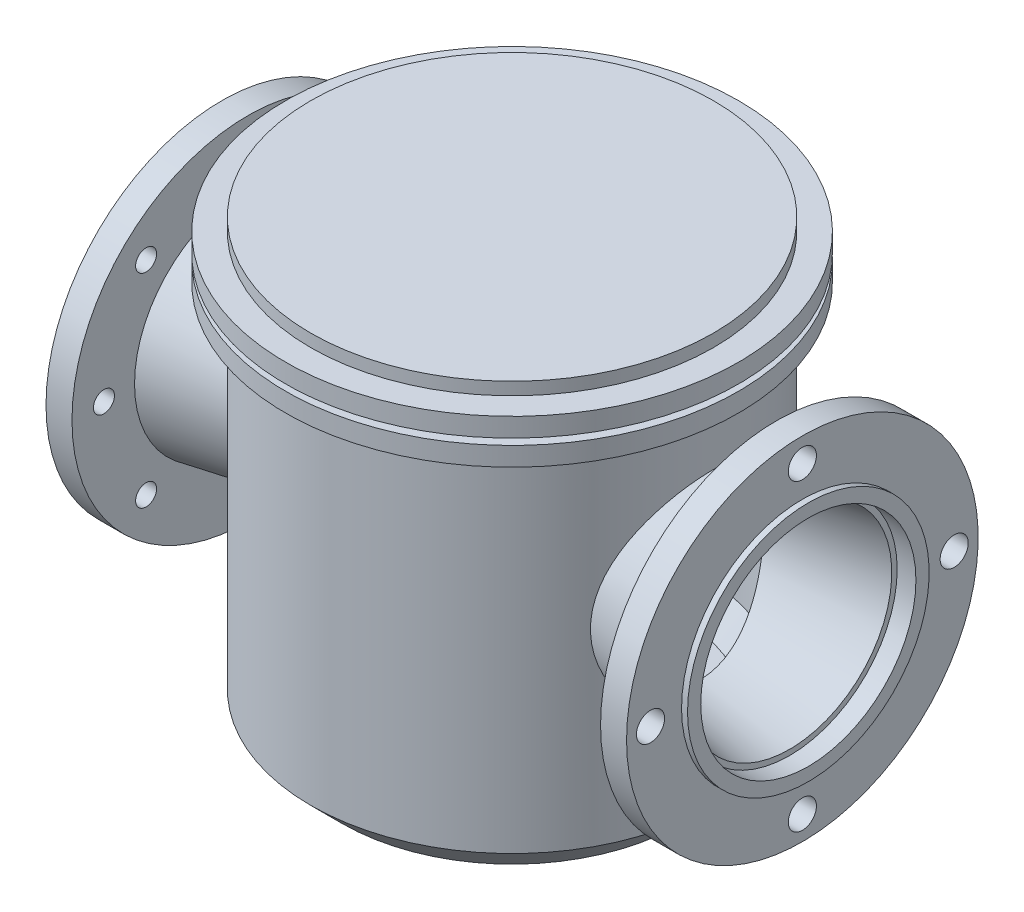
ISO-10303-21;
HEADER;
FILE_DESCRIPTION(('STEP AP214'),'2;1');
FILE_NAME('part.step','',(''),(''),'','','');
FILE_SCHEMA(('AUTOMOTIVE_DESIGN { 1 0 10303 214 1 1 1 1 }'));
ENDSEC;
DATA;
#1=APPLICATION_CONTEXT('core data for automotive mechanical design processes');
#2=APPLICATION_PROTOCOL_DEFINITION('international standard','automotive_design',2000,#1);
#3=PRODUCT_CONTEXT('',#1,'mechanical');
#4=PRODUCT('Part','Part','',(#3));
#5=PRODUCT_RELATED_PRODUCT_CATEGORY('part','',(#4));
#6=PRODUCT_DEFINITION_FORMATION('','',#4);
#7=PRODUCT_DEFINITION_CONTEXT('part definition',#1,'design');
#8=PRODUCT_DEFINITION('design','',#6,#7);
#9=PRODUCT_DEFINITION_SHAPE('','',#8);
#10=(LENGTH_UNIT() NAMED_UNIT(*) SI_UNIT(.MILLI.,.METRE.));
#11=(NAMED_UNIT(*) PLANE_ANGLE_UNIT() SI_UNIT($,.RADIAN.));
#12=(NAMED_UNIT(*) SI_UNIT($,.STERADIAN.) SOLID_ANGLE_UNIT());
#13=UNCERTAINTY_MEASURE_WITH_UNIT(LENGTH_MEASURE(1.E-05),#10,'distance_accuracy_value','');
#14=(GEOMETRIC_REPRESENTATION_CONTEXT(3) GLOBAL_UNCERTAINTY_ASSIGNED_CONTEXT((#13)) GLOBAL_UNIT_ASSIGNED_CONTEXT((#10,
#11,#12)) REPRESENTATION_CONTEXT('',''));
#15=CARTESIAN_POINT('',(0.,0.,0.));
#16=DIRECTION('',(0.,0.,1.));
#17=DIRECTION('',(1.,0.,0.));
#18=AXIS2_PLACEMENT_3D('',#15,#16,#17);
#19=CARTESIAN_POINT('',(0.,0.,0.));
#20=DIRECTION('',(1.,0.,0.));
#21=DIRECTION('',(0.,0.,1.));
#22=AXIS2_PLACEMENT_3D('',#19,#20,#21);
#23=CYLINDRICAL_SURFACE('',#22,85.5);
#24=CARTESIAN_POINT('',(-220.5,0.,0.));
#25=DIRECTION('',(1.,0.,0.));
#26=DIRECTION('',(0.,0.,-1.));
#27=AXIS2_PLACEMENT_3D('',#24,#25,#26);
#28=CIRCLE('',#27,85.5);
#29=CARTESIAN_POINT('',(-220.5,0.,-85.5));
#30=VERTEX_POINT('',#29);
#31=EDGE_CURVE('E172',#30,#30,#28,.F.);
#32=ORIENTED_EDGE('',*,*,#31,.F.);
#33=EDGE_LOOP('',(#32));
#34=FACE_BOUND('',#33,.T.);
#35=CARTESIAN_POINT('',(-230.65,0.,0.));
#36=DIRECTION('',(-1.,0.,0.));
#37=DIRECTION('',(0.,0.,1.));
#38=AXIS2_PLACEMENT_3D('',#35,#36,#37);
#39=CIRCLE('',#38,85.5);
#40=CARTESIAN_POINT('',(-230.65,0.,85.5));
#41=VERTEX_POINT('',#40);
#42=EDGE_CURVE('E40',#41,#41,#39,.F.);
#43=ORIENTED_EDGE('',*,*,#42,.F.);
#44=EDGE_LOOP('',(#43));
#45=FACE_BOUND('',#44,.T.);
#46=ADVANCED_FACE('F36',(#34,#45),#23,.F.);
#47=CARTESIAN_POINT('',(235.4,96.,0.));
#48=DIRECTION('',(1.,0.,0.));
#49=DIRECTION('',(0.,0.,-1.));
#50=AXIS2_PLACEMENT_3D('',#47,#48,#49);
#51=PLANE('',#50);
#52=CARTESIAN_POINT('',(235.4,0.,0.));
#53=DIRECTION('',(-1.,0.,0.));
#54=DIRECTION('',(0.,0.,1.));
#55=AXIS2_PLACEMENT_3D('',#52,#53,#54);
#56=CIRCLE('',#55,96.);
#57=CARTESIAN_POINT('',(235.4,0.,96.));
#58=VERTEX_POINT('',#57);
#59=EDGE_CURVE('E170',#58,#58,#56,.T.);
#60=ORIENTED_EDGE('',*,*,#59,.F.);
#61=EDGE_LOOP('',(#60));
#62=FACE_BOUND('',#61,.T.);
#63=CARTESIAN_POINT('',(235.4,0.,0.));
#64=DIRECTION('',(1.,0.,0.));
#65=DIRECTION('',(0.,0.,-1.));
#66=AXIS2_PLACEMENT_3D('',#63,#64,#65);
#67=CIRCLE('',#66,85.5);
#68=CARTESIAN_POINT('',(235.4,0.,-85.5));
#69=VERTEX_POINT('',#68);
#70=EDGE_CURVE('E593',#69,#69,#67,.F.);
#71=ORIENTED_EDGE('',*,*,#70,.T.);
#72=EDGE_LOOP('',(#71));
#73=FACE_BOUND('',#72,.T.);
#74=ADVANCED_FACE('F68',(#62,#73),#51,.T.);
#75=CARTESIAN_POINT('',(0.,-64.0794081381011,0.));
#76=DIRECTION('',(0.,-1.,0.));
#77=DIRECTION('',(0.,0.,-1.));
#78=AXIS2_PLACEMENT_3D('',#75,#76,#77);
#79=CYLINDRICAL_SURFACE('',#78,160.);
#80=CARTESIAN_POINT('',(0.,150.,0.));
#81=DIRECTION('',(0.,-1.,0.));
#82=DIRECTION('',(0.,0.,-1.));
#83=AXIS2_PLACEMENT_3D('',#80,#81,#82);
#84=CIRCLE('',#83,160.);
#85=CARTESIAN_POINT('',(0.,150.,-160.));
#86=VERTEX_POINT('',#85);
#87=EDGE_CURVE('E222',#86,#86,#84,.F.);
#88=ORIENTED_EDGE('',*,*,#87,.F.);
#89=EDGE_LOOP('',(#88));
#90=FACE_BOUND('',#89,.T.);
#91=CARTESIAN_POINT('',(0.,145.,0.));
#92=DIRECTION('',(0.,-1.,0.));
#93=DIRECTION('',(0.,0.,-1.));
#94=AXIS2_PLACEMENT_3D('',#91,#92,#93);
#95=CIRCLE('',#94,160.);
#96=CARTESIAN_POINT('',(0.,145.,-160.));
#97=VERTEX_POINT('',#96);
#98=EDGE_CURVE('E190',#97,#97,#95,.T.);
#99=ORIENTED_EDGE('',*,*,#98,.F.);
#100=EDGE_LOOP('',(#99));
#101=FACE_BOUND('',#100,.T.);
#102=ADVANCED_FACE('F71',(#90,#101),#79,.T.);
#103=CARTESIAN_POINT('',(160.,150.,0.));
#104=DIRECTION('',(0.,-1.,0.));
#105=DIRECTION('',(0.,0.,-1.));
#106=AXIS2_PLACEMENT_3D('',#103,#104,#105);
#107=PLANE('',#106);
#108=CARTESIAN_POINT('',(0.,150.,0.));
#109=DIRECTION('',(0.,-1.,0.));
#110=DIRECTION('',(0.,0.,-1.));
#111=AXIS2_PLACEMENT_3D('',#108,#109,#110);
#112=CIRCLE('',#111,180.);
#113=CARTESIAN_POINT('',(0.,150.,-180.));
#114=VERTEX_POINT('',#113);
#115=EDGE_CURVE('E205',#114,#114,#112,.T.);
#116=ORIENTED_EDGE('',*,*,#115,.T.);
#117=EDGE_LOOP('',(#116));
#118=FACE_BOUND('',#117,.T.);
#119=ORIENTED_EDGE('',*,*,#87,.T.);
#120=EDGE_LOOP('',(#119));
#121=FACE_BOUND('',#120,.T.);
#122=ADVANCED_FACE('F113',(#118,#121),#107,.T.);
#123=CARTESIAN_POINT('',(0.,0.,0.));
#124=DIRECTION('',(0.,-1.,0.));
#125=DIRECTION('',(0.,0.,-1.));
#126=AXIS2_PLACEMENT_3D('',#123,#124,#125);
#127=CYLINDRICAL_SURFACE('',#126,180.);
#128=ORIENTED_EDGE('',*,*,#115,.F.);
#129=EDGE_LOOP('',(#128));
#130=FACE_BOUND('',#129,.T.);
#131=CARTESIAN_POINT('',(0.,165.,0.));
#132=DIRECTION('',(0.,-1.,0.));
#133=DIRECTION('',(0.,0.,-1.));
#134=AXIS2_PLACEMENT_3D('',#131,#132,#133);
#135=CIRCLE('',#134,180.);
#136=CARTESIAN_POINT('',(0.,165.,-180.));
#137=VERTEX_POINT('',#136);
#138=EDGE_CURVE('E202',#137,#137,#135,.T.);
#139=ORIENTED_EDGE('',*,*,#138,.T.);
#140=EDGE_LOOP('',(#139));
#141=FACE_BOUND('',#140,.T.);
#142=ADVANCED_FACE('F109',(#130,#141),#127,.T.);
#143=CARTESIAN_POINT('',(160.,165.,0.));
#144=DIRECTION('',(0.,-1.,0.));
#145=DIRECTION('',(0.,0.,-1.));
#146=AXIS2_PLACEMENT_3D('',#143,#144,#145);
#147=PLANE('',#146);
#148=ORIENTED_EDGE('',*,*,#138,.F.);
#149=EDGE_LOOP('',(#148));
#150=FACE_BOUND('',#149,.T.);
#151=CARTESIAN_POINT('',(0.,165.,0.));
#152=DIRECTION('',(0.,-1.,0.));
#153=DIRECTION('',(0.,0.,-1.));
#154=AXIS2_PLACEMENT_3D('',#151,#152,#153);
#155=CIRCLE('',#154,160.);
#156=CARTESIAN_POINT('',(0.,165.,-160.));
#157=VERTEX_POINT('',#156);
#158=EDGE_CURVE('E199',#157,#157,#155,.T.);
#159=ORIENTED_EDGE('',*,*,#158,.T.);
#160=EDGE_LOOP('',(#159));
#161=FACE_BOUND('',#160,.T.);
#162=ADVANCED_FACE('F106',(#150,#161),#147,.F.);
#163=CARTESIAN_POINT('',(160.,175.,0.));
#164=DIRECTION('',(0.,1.,0.));
#165=DIRECTION('',(0.,0.,1.));
#166=AXIS2_PLACEMENT_3D('',#163,#164,#165);
#167=PLANE('',#166);
#168=CARTESIAN_POINT('',(0.,175.,0.));
#169=DIRECTION('',(0.,-1.,0.));
#170=DIRECTION('',(0.,0.,-1.));
#171=AXIS2_PLACEMENT_3D('',#168,#169,#170);
#172=CIRCLE('',#171,160.);
#173=CARTESIAN_POINT('',(0.,175.,-160.));
#174=VERTEX_POINT('',#173);
#175=EDGE_CURVE('E219',#174,#174,#172,.T.);
#176=ORIENTED_EDGE('',*,*,#175,.F.);
#177=EDGE_LOOP('',(#176));
#178=FACE_BOUND('',#177,.T.);
#179=ADVANCED_FACE('F38',(#178),#167,.T.);
#180=ORIENTED_EDGE('',*,*,#175,.T.);
#181=EDGE_LOOP('',(#180));
#182=FACE_BOUND('',#181,.T.);
#183=ORIENTED_EDGE('',*,*,#158,.F.);
#184=EDGE_LOOP('',(#183));
#185=FACE_BOUND('',#184,.T.);
#186=ADVANCED_FACE('F104',(#182,#185),#79,.T.);
#187=CARTESIAN_POINT('',(160.,130.,0.));
#188=DIRECTION('',(0.,-1.,0.));
#189=DIRECTION('',(0.,0.,-1.));
#190=AXIS2_PLACEMENT_3D('',#187,#188,#189);
#191=PLANE('',#190);
#192=CARTESIAN_POINT('',(0.,130.,0.));
#193=DIRECTION('',(0.,-1.,0.));
#194=DIRECTION('',(0.,0.,-1.));
#195=AXIS2_PLACEMENT_3D('',#192,#193,#194);
#196=CIRCLE('',#195,180.);
#197=CARTESIAN_POINT('',(0.,130.,-180.));
#198=VERTEX_POINT('',#197);
#199=EDGE_CURVE('E196',#198,#198,#196,.T.);
#200=ORIENTED_EDGE('',*,*,#199,.T.);
#201=EDGE_LOOP('',(#200));
#202=FACE_BOUND('',#201,.T.);
#203=CARTESIAN_POINT('',(0.,130.,0.));
#204=DIRECTION('',(0.,-1.,0.));
#205=DIRECTION('',(0.,0.,-1.));
#206=AXIS2_PLACEMENT_3D('',#203,#204,#205);
#207=CIRCLE('',#206,160.);
#208=CARTESIAN_POINT('',(0.,130.,-160.));
#209=VERTEX_POINT('',#208);
#210=EDGE_CURVE('E48',#209,#209,#207,.F.);
#211=ORIENTED_EDGE('',*,*,#210,.T.);
#212=EDGE_LOOP('',(#211));
#213=FACE_BOUND('',#212,.T.);
#214=ADVANCED_FACE('F100',(#202,#213),#191,.T.);
#215=CARTESIAN_POINT('',(0.,0.,0.));
#216=DIRECTION('',(0.,-1.,0.));
#217=DIRECTION('',(0.,0.,-1.));
#218=AXIS2_PLACEMENT_3D('',#215,#216,#217);
#219=CYLINDRICAL_SURFACE('',#218,180.);
#220=ORIENTED_EDGE('',*,*,#199,.F.);
#221=EDGE_LOOP('',(#220));
#222=FACE_BOUND('',#221,.T.);
#223=CARTESIAN_POINT('',(0.,145.,0.));
#224=DIRECTION('',(0.,-1.,0.));
#225=DIRECTION('',(0.,0.,-1.));
#226=AXIS2_PLACEMENT_3D('',#223,#224,#225);
#227=CIRCLE('',#226,180.);
#228=CARTESIAN_POINT('',(0.,145.,-180.));
#229=VERTEX_POINT('',#228);
#230=EDGE_CURVE('E193',#229,#229,#227,.T.);
#231=ORIENTED_EDGE('',*,*,#230,.T.);
#232=EDGE_LOOP('',(#231));
#233=FACE_BOUND('',#232,.T.);
#234=ADVANCED_FACE('F96',(#222,#233),#219,.T.);
#235=CARTESIAN_POINT('',(160.,145.,0.));
#236=DIRECTION('',(0.,-1.,0.));
#237=DIRECTION('',(0.,0.,-1.));
#238=AXIS2_PLACEMENT_3D('',#235,#236,#237);
#239=PLANE('',#238);
#240=ORIENTED_EDGE('',*,*,#230,.F.);
#241=EDGE_LOOP('',(#240));
#242=FACE_BOUND('',#241,.T.);
#243=ORIENTED_EDGE('',*,*,#98,.T.);
#244=EDGE_LOOP('',(#243));
#245=FACE_BOUND('',#244,.T.);
#246=ADVANCED_FACE('F92',(#242,#245),#239,.F.);
#247=CARTESIAN_POINT('',(0.,-185.,0.));
#248=DIRECTION('',(0.,-1.,0.));
#249=DIRECTION('',(0.,0.,-1.));
#250=AXIS2_PLACEMENT_3D('',#247,#248,#249);
#251=PLANE('',#250);
#252=CARTESIAN_POINT('',(0.,-185.,0.));
#253=DIRECTION('',(0.,-1.,0.));
#254=DIRECTION('',(0.,0.,-1.));
#255=AXIS2_PLACEMENT_3D('',#252,#253,#254);
#256=CIRCLE('',#255,50.);
#257=CARTESIAN_POINT('',(0.,-185.,-50.));
#258=VERTEX_POINT('',#257);
#259=EDGE_CURVE('E208',#258,#258,#256,.T.);
#260=ORIENTED_EDGE('',*,*,#259,.T.);
#261=EDGE_LOOP('',(#260));
#262=FACE_BOUND('',#261,.T.);
#263=ADVANCED_FACE('F95',(#262),#251,.T.);
#264=CARTESIAN_POINT('',(0.,-64.0794081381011,0.));
#265=DIRECTION('',(0.,-1.,0.));
#266=DIRECTION('',(0.,0.,-1.));
#267=AXIS2_PLACEMENT_3D('',#264,#265,#266);
#268=CYLINDRICAL_SURFACE('',#267,50.);
#269=CARTESIAN_POINT('',(0.,-175.,0.));
#270=DIRECTION('',(0.,-1.,0.));
#271=DIRECTION('',(0.,0.,-1.));
#272=AXIS2_PLACEMENT_3D('',#269,#270,#271);
#273=CIRCLE('',#272,50.);
#274=CARTESIAN_POINT('',(0.,-175.,-50.));
#275=VERTEX_POINT('',#274);
#276=EDGE_CURVE('E211',#275,#275,#273,.T.);
#277=ORIENTED_EDGE('',*,*,#276,.T.);
#278=EDGE_LOOP('',(#277));
#279=FACE_BOUND('',#278,.T.);
#280=ORIENTED_EDGE('',*,*,#259,.F.);
#281=EDGE_LOOP('',(#280));
#282=FACE_BOUND('',#281,.T.);
#283=ADVANCED_FACE('F120',(#279,#282),#268,.T.);
#284=CARTESIAN_POINT('',(50.,-175.,0.));
#285=DIRECTION('',(0.,-1.,0.));
#286=DIRECTION('',(0.,0.,-1.));
#287=AXIS2_PLACEMENT_3D('',#284,#285,#286);
#288=PLANE('',#287);
#289=CARTESIAN_POINT('',(0.,-175.,0.));
#290=DIRECTION('',(0.,-1.,0.));
#291=DIRECTION('',(0.,0.,-1.));
#292=AXIS2_PLACEMENT_3D('',#289,#290,#291);
#293=CIRCLE('',#292,135.);
#294=CARTESIAN_POINT('',(0.,-175.,-135.));
#295=VERTEX_POINT('',#294);
#296=EDGE_CURVE('E214',#295,#295,#293,.T.);
#297=ORIENTED_EDGE('',*,*,#296,.T.);
#298=EDGE_LOOP('',(#297));
#299=FACE_BOUND('',#298,.T.);
#300=ORIENTED_EDGE('',*,*,#276,.F.);
#301=EDGE_LOOP('',(#300));
#302=FACE_BOUND('',#301,.T.);
#303=ADVANCED_FACE('F124',(#299,#302),#288,.T.);
#304=CARTESIAN_POINT('',(0.,-175.,0.));
#305=DIRECTION('',(0.,1.,0.));
#306=DIRECTION('',(0.,0.,1.));
#307=AXIS2_PLACEMENT_3D('',#304,#305,#306);
#308=CONICAL_SURFACE('',#307,135.,0.78539816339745);
#309=CARTESIAN_POINT('',(0.,-150.,0.));
#310=DIRECTION('',(0.,-1.,0.));
#311=DIRECTION('',(0.,0.,-1.));
#312=AXIS2_PLACEMENT_3D('',#309,#310,#311);
#313=CIRCLE('',#312,160.);
#314=CARTESIAN_POINT('',(0.,-150.,-160.));
#315=VERTEX_POINT('',#314);
#316=EDGE_CURVE('E217',#315,#315,#313,.T.);
#317=ORIENTED_EDGE('',*,*,#316,.T.);
#318=EDGE_LOOP('',(#317));
#319=FACE_BOUND('',#318,.T.);
#320=ORIENTED_EDGE('',*,*,#296,.F.);
#321=EDGE_LOOP('',(#320));
#322=FACE_BOUND('',#321,.T.);
#323=ADVANCED_FACE('F127',(#319,#322),#308,.T.);
#324=CARTESIAN_POINT('',(-149.303577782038,-54.5863080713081,-57.5190547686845));
#325=CARTESIAN_POINT('',(-149.855940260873,-56.238611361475,-56.0852695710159));
#326=CARTESIAN_POINT('',(-150.410648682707,-57.8315781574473,-54.5838062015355));
#327=CARTESIAN_POINT('',(-151.510773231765,-60.8894292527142,-51.451353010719));
#328=CARTESIAN_POINT('',(-152.056185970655,-62.3542676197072,-49.8203171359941));
#329=CARTESIAN_POINT('',(-153.124456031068,-65.1472791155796,-46.4333880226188));
#330=CARTESIAN_POINT('',(-153.647274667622,-66.4752228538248,-44.6772932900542));
#331=CARTESIAN_POINT('',(-154.655704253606,-68.9808814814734,-41.050608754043));
#332=CARTESIAN_POINT('',(-155.141318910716,-70.1586113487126,-39.1800303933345));
#333=CARTESIAN_POINT('',(-155.83289909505,-71.8064235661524,-36.2918145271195));
#334=CARTESIAN_POINT('',(-156.057804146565,-72.3370804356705,-35.3127853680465));
#335=CARTESIAN_POINT('',(-156.493277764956,-73.3561711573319,-33.3299214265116));
#336=CARTESIAN_POINT('',(-156.703847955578,-73.8446097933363,-32.3260894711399));
#337=CARTESIAN_POINT('',(-157.109144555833,-74.7779334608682,-30.2950390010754));
#338=CARTESIAN_POINT('',(-157.303868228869,-75.2228109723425,-29.2678164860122));
#339=CARTESIAN_POINT('',(-157.675946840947,-76.067489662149,-27.1920462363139));
#340=CARTESIAN_POINT('',(-157.853303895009,-76.4672963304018,-26.1435011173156));
#341=CARTESIAN_POINT('',(-158.18913312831,-77.220184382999,-24.0279848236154));
#342=CARTESIAN_POINT('',(-158.347623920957,-77.573311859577,-22.9610330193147));
#343=CARTESIAN_POINT('',(-158.644649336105,-78.2320232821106,-20.8099470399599));
#344=CARTESIAN_POINT('',(-158.78318639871,-78.5376130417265,-19.7258149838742));
#345=CARTESIAN_POINT('',(-159.039195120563,-79.1001523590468,-17.5425872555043));
#346=CARTESIAN_POINT('',(-159.156667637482,-79.3571038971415,-16.4434921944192));
#347=CARTESIAN_POINT('',(-159.369574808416,-79.8213770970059,-14.2327669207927));
#348=CARTESIAN_POINT('',(-159.465010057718,-80.028700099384,-13.1211370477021));
#349=CARTESIAN_POINT('',(-159.624605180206,-80.3746077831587,-11.0000163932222));
#350=CARTESIAN_POINT('',(-159.690942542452,-80.518002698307,-9.99147069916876));
#351=CARTESIAN_POINT('',(-159.804675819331,-80.7634846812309,-7.96820211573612));
#352=CARTESIAN_POINT('',(-159.852070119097,-80.865568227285,-6.95347870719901));
#353=CARTESIAN_POINT('',(-159.927568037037,-81.0280432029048,-4.92014840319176));
#354=CARTESIAN_POINT('',(-159.955674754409,-81.0884413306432,-3.90154215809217));
#355=CARTESIAN_POINT('',(-159.992412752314,-81.1673660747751,-1.86225006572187));
#356=CARTESIAN_POINT('',(-160.001042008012,-81.1858883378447,-0.841564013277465));
#357=CARTESIAN_POINT('',(-159.998757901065,-81.1809839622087,1.19941625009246));
#358=CARTESIAN_POINT('',(-159.987849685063,-81.1575683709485,2.21971049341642));
#359=CARTESIAN_POINT('',(-159.94657814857,-81.0688917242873,4.25808903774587));
#360=CARTESIAN_POINT('',(-159.916214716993,-81.0036304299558,5.27617332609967));
#361=CARTESIAN_POINT('',(-159.836248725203,-80.8314915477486,7.30802798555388));
#362=CARTESIAN_POINT('',(-159.786646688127,-80.7246150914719,8.32179847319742));
#363=CARTESIAN_POINT('',(-159.668552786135,-80.4696138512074,10.3430221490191));
#364=CARTESIAN_POINT('',(-159.600061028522,-80.3214893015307,11.3504753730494));
#365=CARTESIAN_POINT('',(-159.449772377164,-79.9955686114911,13.2911194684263));
#366=CARTESIAN_POINT('',(-159.369146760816,-79.8203645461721,14.2248368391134));
#367=CARTESIAN_POINT('',(-159.192310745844,-79.4348931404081,16.0835413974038));
#368=CARTESIAN_POINT('',(-159.096099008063,-79.2246227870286,17.0085278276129));
#369=CARTESIAN_POINT('',(-158.78493158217,-78.5421065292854,19.7678664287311));
#370=CARTESIAN_POINT('',(-158.547397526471,-78.0180560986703,21.5871872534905));
#371=CARTESIAN_POINT('',(-158.017602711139,-76.8374271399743,25.1739143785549));
#372=CARTESIAN_POINT('',(-157.725337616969,-76.180838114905,26.9413165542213));
#373=CARTESIAN_POINT('',(-157.092471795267,-74.7413249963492,30.4149985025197));
#374=CARTESIAN_POINT('',(-156.75186860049,-73.9583944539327,32.121275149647));
#375=CARTESIAN_POINT('',(-156.010192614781,-72.2279166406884,35.5536936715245));
#376=CARTESIAN_POINT('',(-155.606863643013,-71.273816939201,37.2760418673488));
#377=CARTESIAN_POINT('',(-154.763449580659,-69.2408242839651,40.6358870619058));
#378=CARTESIAN_POINT('',(-154.323363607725,-68.1619283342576,42.2733820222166));
#379=CARTESIAN_POINT('',(-153.415636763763,-65.8867520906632,45.4574999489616));
#380=CARTESIAN_POINT('',(-152.947985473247,-64.6904272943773,47.0040881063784));
#381=CARTESIAN_POINT('',(-151.994923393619,-62.1882792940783,50.0001506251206));
#382=CARTESIAN_POINT('',(-151.509511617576,-60.8824499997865,51.44961957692));
#383=CARTESIAN_POINT('',(-150.473966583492,-58.0110267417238,54.4088160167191));
#384=CARTESIAN_POINT('',(-149.92285688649,-56.4328709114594,55.9060320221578));
#385=CARTESIAN_POINT('',(-148.824595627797,-53.158709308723,58.76724130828));
#386=CARTESIAN_POINT('',(-148.277444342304,-51.4626953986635,60.1312253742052));
#387=CARTESIAN_POINT('',(-147.200822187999,-47.9613501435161,62.7206936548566));
#388=CARTESIAN_POINT('',(-146.67136077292,-46.1559617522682,63.9461046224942));
#389=CARTESIAN_POINT('',(-145.644364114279,-42.4457631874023,66.2518868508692));
#390=CARTESIAN_POINT('',(-145.146829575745,-40.5409508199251,67.3322549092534));
#391=CARTESIAN_POINT('',(-144.419914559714,-37.555295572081,68.8711645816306));
#392=CARTESIAN_POINT('',(-144.174025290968,-36.5061088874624,69.3840642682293));
#393=CARTESIAN_POINT('',(-143.697251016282,-34.3841777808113,70.3661710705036));
#394=CARTESIAN_POINT('',(-143.466364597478,-33.3114355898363,70.8353823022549));
#395=CARTESIAN_POINT('',(-143.021537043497,-31.1439037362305,71.7292774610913));
#396=CARTESIAN_POINT('',(-142.807598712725,-30.0491104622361,72.1539540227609));
#397=CARTESIAN_POINT('',(-142.398631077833,-27.8395804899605,72.9577494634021));
#398=CARTESIAN_POINT('',(-142.20359962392,-26.724846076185,73.3368735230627));
#399=CARTESIAN_POINT('',(-141.83431918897,-24.4778846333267,74.0485418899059));
#400=CARTESIAN_POINT('',(-141.6600590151,-23.3456674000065,74.3811113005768));
#401=CARTESIAN_POINT('',(-141.333879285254,-21.0653683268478,74.9990442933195));
#402=CARTESIAN_POINT('',(-141.18195730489,-19.9172882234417,75.2844129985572));
#403=CARTESIAN_POINT('',(-140.901932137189,-17.6074053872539,75.8072125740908));
#404=CARTESIAN_POINT('',(-140.77382849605,-16.4456029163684,76.0446443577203));
#405=CARTESIAN_POINT('',(-140.542738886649,-14.1106404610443,76.4708922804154));
#406=CARTESIAN_POINT('',(-140.439752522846,-12.9374806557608,76.6597091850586));
#407=CARTESIAN_POINT('',(-140.265551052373,-10.6554634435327,76.9779577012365));
#408=CARTESIAN_POINT('',(-140.192759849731,-9.54713815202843,77.1103494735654));
#409=CARTESIAN_POINT('',(-140.070889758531,-7.32484717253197,77.3315059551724));
#410=CARTESIAN_POINT('',(-140.021810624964,-6.2108815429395,77.4202711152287));
#411=CARTESIAN_POINT('',(-139.947830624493,-3.97955552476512,77.5539202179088));
#412=CARTESIAN_POINT('',(-139.922928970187,-2.8621952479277,77.5988055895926));
#413=CARTESIAN_POINT('',(-139.897538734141,-0.626292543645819,77.6445706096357));
#414=CARTESIAN_POINT('',(-139.897050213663,0.492249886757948,77.6454501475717));
#415=CARTESIAN_POINT('',(-139.920489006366,2.72804350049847,77.603204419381));
#416=CARTESIAN_POINT('',(-139.944411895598,3.84529488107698,77.5600871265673));
#417=CARTESIAN_POINT('',(-140.01643834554,6.07645753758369,77.4299845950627));
#418=CARTESIAN_POINT('',(-140.064541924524,7.190368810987,77.3429993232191));
#419=CARTESIAN_POINT('',(-140.184472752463,9.4126129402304,77.1254109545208));
#420=CARTESIAN_POINT('',(-140.256299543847,10.5209459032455,76.9948086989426));
#421=CARTESIAN_POINT('',(-140.423005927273,12.7298966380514,76.690348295));
#422=CARTESIAN_POINT('',(-140.51788527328,13.8305144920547,76.5164906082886));
#423=CARTESIAN_POINT('',(-140.723609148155,15.9576930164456,76.1374382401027));
#424=CARTESIAN_POINT('',(-140.833190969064,16.9848112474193,75.9346794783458));
#425=CARTESIAN_POINT('',(-141.071147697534,19.0288175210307,75.4916849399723));
#426=CARTESIAN_POINT('',(-141.199524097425,20.0457047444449,75.2514461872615));
#427=CARTESIAN_POINT('',(-141.474054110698,22.0674704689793,74.7340470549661));
#428=CARTESIAN_POINT('',(-141.620205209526,23.0723506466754,74.45689189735));
#429=CARTESIAN_POINT('',(-141.929193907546,25.0687910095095,73.8661955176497));
#430=CARTESIAN_POINT('',(-142.09203299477,26.0603499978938,73.5526510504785));
#431=CARTESIAN_POINT('',(-142.603877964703,29.0132007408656,72.5581925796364));
#432=CARTESIAN_POINT('',(-142.97621282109,30.9526754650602,71.8234511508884));
#433=CARTESIAN_POINT('',(-143.772583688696,34.7621815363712,70.2157254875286));
#434=CARTESIAN_POINT('',(-144.196622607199,36.632208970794,69.3427334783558));
#435=CARTESIAN_POINT('',(-145.112631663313,40.4063963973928,67.4057927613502));
#436=CARTESIAN_POINT('',(-145.607173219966,42.3056138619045,66.3334154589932));
#437=CARTESIAN_POINT('',(-146.628356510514,46.0059584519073,64.0444782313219));
#438=CARTESIAN_POINT('',(-147.154999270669,47.8070824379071,62.8279136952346));
#439=CARTESIAN_POINT('',(-148.226810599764,51.3028199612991,60.2557424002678));
#440=CARTESIAN_POINT('',(-148.771988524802,52.9973784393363,58.9000647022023));
#441=CARTESIAN_POINT('',(-149.866779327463,56.2697644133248,56.0559544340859));
#442=CARTESIAN_POINT('',(-150.41639236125,57.8475877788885,54.5675171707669));
#443=CARTESIAN_POINT('',(-151.54274280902,60.9782424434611,51.3602542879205));
#444=CARTESIAN_POINT('',(-152.118837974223,62.5223552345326,49.6326793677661));
#445=CARTESIAN_POINT('',(-153.244082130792,65.4549995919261,46.0411782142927));
#446=CARTESIAN_POINT('',(-153.793229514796,66.8435218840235,44.1772438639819));
#447=CARTESIAN_POINT('',(-154.584395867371,68.7992579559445,41.2875701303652));
#448=CARTESIAN_POINT('',(-154.842693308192,69.4299980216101,40.308712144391));
#449=CARTESIAN_POINT('',(-155.346559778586,70.6476512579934,38.3209722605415));
#450=CARTESIAN_POINT('',(-155.592130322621,71.2345696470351,37.3120939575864));
#451=CARTESIAN_POINT('',(-156.068657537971,72.3629606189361,35.2658180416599));
#452=CARTESIAN_POINT('',(-156.299613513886,72.9044310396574,34.2284190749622));
#453=CARTESIAN_POINT('',(-156.745041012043,73.9401846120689,32.127019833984));
#454=CARTESIAN_POINT('',(-156.959514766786,74.4344741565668,31.0630231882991));
#455=CARTESIAN_POINT('',(-157.357924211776,75.3460898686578,28.9748971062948));
#456=CARTESIAN_POINT('',(-157.542920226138,75.7662549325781,27.9522086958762));
#457=CARTESIAN_POINT('',(-157.895433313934,76.5621571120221,25.8868581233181));
#458=CARTESIAN_POINT('',(-158.062952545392,76.9378997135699,24.8441984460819));
#459=CARTESIAN_POINT('',(-158.379266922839,77.64378066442,22.7406913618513));
#460=CARTESIAN_POINT('',(-158.528061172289,77.9739168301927,21.6798430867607));
#461=CARTESIAN_POINT('',(-158.805752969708,78.5874032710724,19.5421219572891));
#462=CARTESIAN_POINT('',(-158.934650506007,78.8707535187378,18.4652490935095));
#463=CARTESIAN_POINT('',(-159.171417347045,79.3894028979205,16.2986631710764));
#464=CARTESIAN_POINT('',(-159.27930417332,79.6247420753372,15.2089616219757));
#465=CARTESIAN_POINT('',(-159.473302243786,80.0467585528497,13.0182575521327));
#466=CARTESIAN_POINT('',(-159.559413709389,80.2334363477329,11.9172551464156));
#467=CARTESIAN_POINT('',(-159.709140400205,80.5573743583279,9.70658255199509));
#468=CARTESIAN_POINT('',(-159.772757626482,80.6946389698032,8.59691314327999));
#469=CARTESIAN_POINT('',(-159.876968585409,80.9192079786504,6.37147129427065));
#470=CARTESIAN_POINT('',(-159.917563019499,81.0065138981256,5.25569904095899));
#471=CARTESIAN_POINT('',(-159.971978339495,81.1234803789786,3.15255005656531));
#472=CARTESIAN_POINT('',(-159.988391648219,81.1587239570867,2.16554597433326));
#473=CARTESIAN_POINT('',(-160.002933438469,81.1899506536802,0.190694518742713));
#474=CARTESIAN_POINT('',(-160.00106048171,81.1859306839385,-0.797152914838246));
#475=CARTESIAN_POINT('',(-159.979039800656,81.1386388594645,-2.77151957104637));
#476=CARTESIAN_POINT('',(-159.958895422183,81.0953741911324,-3.75803900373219));
#477=CARTESIAN_POINT('',(-159.90046796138,80.9697390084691,-5.72814336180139));
#478=CARTESIAN_POINT('',(-159.862183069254,80.8873645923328,-6.71172798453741));
#479=CARTESIAN_POINT('',(-159.76773630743,80.6837953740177,-8.67380548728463));
#480=CARTESIAN_POINT('',(-159.711578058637,80.5626084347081,-9.65229935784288));
#481=CARTESIAN_POINT('',(-159.581744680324,80.2817829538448,-11.6026778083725));
#482=CARTESIAN_POINT('',(-159.508067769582,80.1221405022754,-12.5745617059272));
#483=CARTESIAN_POINT('',(-159.343680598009,79.7649161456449,-14.5097984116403));
#484=CARTESIAN_POINT('',(-159.252971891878,79.5673377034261,-15.4731519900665));
#485=CARTESIAN_POINT('',(-159.055100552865,79.1348356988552,-17.3897604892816));
#486=CARTESIAN_POINT('',(-158.94793637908,78.8999086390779,-18.3430144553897));
#487=CARTESIAN_POINT('',(-158.609647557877,78.1553038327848,-21.1282663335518));
#488=CARTESIAN_POINT('',(-158.356659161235,77.5948748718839,-22.9443556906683));
#489=CARTESIAN_POINT('',(-157.797007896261,76.3418098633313,-26.5213779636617));
#490=CARTESIAN_POINT('',(-157.490346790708,75.6491781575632,-28.2823126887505));
#491=CARTESIAN_POINT('',(-156.829981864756,74.1379965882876,-31.7404412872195));
#492=CARTESIAN_POINT('',(-156.4762712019,73.3194284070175,-33.4376258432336));
#493=CARTESIAN_POINT('',(-155.729231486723,71.5632716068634,-36.7601240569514));
#494=CARTESIAN_POINT('',(-155.33590021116,70.6256763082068,-38.3854336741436));
#495=CARTESIAN_POINT('',(-154.483644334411,68.5561879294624,-41.6887076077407));
#496=CARTESIAN_POINT('',(-154.021985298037,67.4146407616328,-43.3599207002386));
#497=CARTESIAN_POINT('',(-153.071848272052,65.0087027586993,-46.6032794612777));
#498=CARTESIAN_POINT('',(-152.583369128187,63.7443066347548,-48.1754208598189));
#499=CARTESIAN_POINT('',(-151.590021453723,61.1002236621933,-51.2154663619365));
#500=CARTESIAN_POINT('',(-151.085144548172,59.7204773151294,-52.6833159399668));
#501=CARTESIAN_POINT('',(-150.070115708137,56.85410354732,-55.5086857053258));
#502=CARTESIAN_POINT('',(-149.5599635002,55.3674705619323,-56.8662001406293));
#503=CARTESIAN_POINT('',(-148.487778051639,52.1203520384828,-59.6137072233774));
#504=CARTESIAN_POINT('',(-147.926427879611,50.3479350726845,-60.9898997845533));
#505=CARTESIAN_POINT('',(-146.826145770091,46.6901226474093,-63.593085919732));
#506=CARTESIAN_POINT('',(-146.287215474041,44.804718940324,-64.8200685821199));
#507=CARTESIAN_POINT('',(-145.246905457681,40.9305514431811,-67.1187669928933));
#508=CARTESIAN_POINT('',(-144.745534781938,38.941762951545,-68.1904454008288));
#509=CARTESIAN_POINT('',(-144.033201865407,35.8904920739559,-69.6759508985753));
#510=CARTESIAN_POINT('',(-143.802350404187,34.8619143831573,-70.1508383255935));
#511=CARTESIAN_POINT('',(-143.35567920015,32.7834522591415,-71.0591685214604));
#512=CARTESIAN_POINT('',(-143.139857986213,31.7335699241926,-71.4926153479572));
#513=CARTESIAN_POINT('',(-142.719940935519,29.5881601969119,-72.327325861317));
#514=CARTESIAN_POINT('',(-142.516260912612,28.4921444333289,-72.727543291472));
#515=CARTESIAN_POINT('',(-142.128362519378,26.2813552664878,-73.4827106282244));
#516=CARTESIAN_POINT('',(-141.94414208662,25.1665838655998,-73.8376653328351));
#517=CARTESIAN_POINT('',(-141.596815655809,22.9199868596,-74.5015583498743));
#518=CARTESIAN_POINT('',(-141.433712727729,21.7881588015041,-74.8104899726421));
#519=CARTESIAN_POINT('',(-141.130228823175,19.5098542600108,-75.3814503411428));
#520=CARTESIAN_POINT('',(-140.989845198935,18.3633795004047,-75.6434845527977));
#521=CARTESIAN_POINT('',(-140.733252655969,16.058732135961,-76.1198052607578));
#522=CARTESIAN_POINT('',(-140.617026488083,14.9005685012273,-76.3341258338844));
#523=CARTESIAN_POINT('',(-140.409809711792,12.5742431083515,-76.7146158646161));
#524=CARTESIAN_POINT('',(-140.318816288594,11.4060824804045,-76.8807906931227));
#525=CARTESIAN_POINT('',(-140.162991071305,9.06215847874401,-77.1645134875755));
#526=CARTESIAN_POINT('',(-140.09815868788,7.88639527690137,-77.2820625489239));
#527=CARTESIAN_POINT('',(-139.99533701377,5.52983900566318,-77.4681673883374));
#528=CARTESIAN_POINT('',(-139.957347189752,4.34904603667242,-77.5367241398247));
#529=CARTESIAN_POINT('',(-139.910621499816,2.08259780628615,-77.6210024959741));
#530=CARTESIAN_POINT('',(-139.899731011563,0.997129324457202,-77.6406159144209));
#531=CARTESIAN_POINT('',(-139.900979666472,-1.1737478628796,-77.6383662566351));
#532=CARTESIAN_POINT('',(-139.91311858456,-2.25915656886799,-77.6165035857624));
#533=CARTESIAN_POINT('',(-139.960315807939,-4.42779159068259,-77.5313636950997));
#534=CARTESIAN_POINT('',(-139.995372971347,-5.51101801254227,-77.4680885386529));
#535=CARTESIAN_POINT('',(-140.088091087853,-7.67330363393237,-77.3002969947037));
#536=CARTESIAN_POINT('',(-140.145752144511,-8.75236281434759,-77.1957804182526));
#537=CARTESIAN_POINT('',(-140.28319643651,-10.9047769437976,-76.9457285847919));
#538=CARTESIAN_POINT('',(-140.362989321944,-11.9781291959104,-76.8001754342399));
#539=CARTESIAN_POINT('',(-140.54399726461,-14.1168145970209,-76.4684282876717));
#540=CARTESIAN_POINT('',(-140.645214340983,-15.1821469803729,-76.2822304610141));
#541=CARTESIAN_POINT('',(-140.868186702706,-17.3027143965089,-75.8696838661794));
#542=CARTESIAN_POINT('',(-140.989939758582,-18.3579505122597,-75.6433394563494));
#543=CARTESIAN_POINT('',(-141.252984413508,-20.4567666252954,-75.1509964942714));
#544=CARTESIAN_POINT('',(-141.394277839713,-21.5003455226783,-74.8849942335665));
#545=CARTESIAN_POINT('',(-141.691868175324,-23.5507968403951,-74.3203474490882));
#546=CARTESIAN_POINT('',(-141.847756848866,-24.5579672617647,-74.0225702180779));
#547=CARTESIAN_POINT('',(-142.175920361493,-26.5580371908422,-73.3902880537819));
#548=CARTESIAN_POINT('',(-142.34819663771,-27.5509354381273,-73.0557798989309));
#549=CARTESIAN_POINT('',(-142.887732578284,-30.506038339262,-71.9980807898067));
#550=CARTESIAN_POINT('',(-143.277753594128,-32.4450197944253,-71.2206135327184));
#551=CARTESIAN_POINT('',(-144.106941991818,-36.2473552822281,-69.5275187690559));
#552=CARTESIAN_POINT('',(-144.546046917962,-38.1108014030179,-68.6120663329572));
#553=CARTESIAN_POINT('',(-145.462267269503,-41.7554712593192,-66.6476013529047));
#554=CARTESIAN_POINT('',(-145.939371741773,-43.5367184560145,-65.5986272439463));
#555=CARTESIAN_POINT('',(-146.891800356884,-46.90952070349,-63.4359012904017));
#556=CARTESIAN_POINT('',(-147.365656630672,-48.5060958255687,-62.3293172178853));
#557=CARTESIAN_POINT('',(-148.326920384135,-51.6127380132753,-60.0058776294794));
#558=CARTESIAN_POINT('',(-148.814328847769,-53.1227987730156,-58.7890140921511));
#559=CARTESIAN_POINT('',(-149.303577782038,-54.5863080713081,-57.5190547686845));
#560=B_SPLINE_CURVE_WITH_KNOTS('',3,(#324,#325,#326,#327,#328,#329,#330,#331,#332,#333,#334,
#335,#336,#337,#338,#339,#340,#341,#342,#343,#344,#345,#346,#347,#348,#349,#350,#351,#352,#353,
#354,#355,#356,#357,#358,#359,#360,#361,#362,#363,#364,#365,#366,#367,#368,#369,#370,#371,#372,
#373,#374,#375,#376,#377,#378,#379,#380,#381,#382,#383,#384,#385,#386,#387,#388,#389,#390,#391,
#392,#393,#394,#395,#396,#397,#398,#399,#400,#401,#402,#403,#404,#405,#406,#407,#408,#409,#410,
#411,#412,#413,#414,#415,#416,#417,#418,#419,#420,#421,#422,#423,#424,#425,#426,#427,#428,#429,
#430,#431,#432,#433,#434,#435,#436,#437,#438,#439,#440,#441,#442,#443,#444,#445,#446,#447,#448,
#449,#450,#451,#452,#453,#454,#455,#456,#457,#458,#459,#460,#461,#462,#463,#464,#465,#466,#467,
#468,#469,#470,#471,#472,#473,#474,#475,#476,#477,#478,#479,#480,#481,#482,#483,#484,#485,#486,
#487,#488,#489,#490,#491,#492,#493,#494,#495,#496,#497,#498,#499,#500,#501,#502,#503,#504,#505,
#506,#507,#508,#509,#510,#511,#512,#513,#514,#515,#516,#517,#518,#519,#520,#521,#522,#523,#524,
#525,#526,#527,#528,#529,#530,#531,#532,#533,#534,#535,#536,#537,#538,#539,#540,#541,#542,#543,
#544,#545,#546,#547,#548,#549,#550,#551,#552,#553,#554,#555,#556,#557,#558,#559),.UNSPECIFIED.,
.T.,.F.,(4,2,2,2,2,2,2,2,2,2,2,2,2,2,2,2,2,2,2,2,2,2,2,2,2,2,2,2,2,2,2,2,2,2,2,2,2,2,2,2,2,2,2,
2,2,2,2,2,2,2,2,2,2,2,2,2,2,2,2,2,2,2,2,2,2,2,2,2,2,2,2,2,2,2,2,2,2,2,2,2,2,2,2,2,2,2,2,2,2,2,2,
2,2,2,2,2,2,2,2,2,2,2,2,2,2,2,2,2,2,2,2,2,2,2,2,2,2,4),(0.,6.76733813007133,13.5370924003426,
20.3180122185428,27.0982553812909,30.5055522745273,33.9124625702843,37.3199599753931,
40.7270418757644,44.1307339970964,47.5340095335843,50.9371464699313,54.3401914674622,
57.4017269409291,60.4635233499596,63.5248276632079,66.5864502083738,69.6472663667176,
72.7081000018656,75.7688504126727,78.8295834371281,81.68902243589,84.5487072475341,
90.2662840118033,95.9843137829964,101.702635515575,107.725925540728,113.749360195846,
119.775086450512,125.80114805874,132.526176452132,139.251669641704,145.980701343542,
152.709881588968,156.289284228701,159.868349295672,163.448005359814,167.027253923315,
170.604564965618,174.181487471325,177.758341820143,181.335139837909,184.689769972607,
188.044365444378,191.398851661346,194.753346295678,198.107233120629,201.46112248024,
204.814947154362,208.168736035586,211.325827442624,214.483169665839,217.640065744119,
220.797243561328,227.111570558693,233.426252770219,240.128279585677,246.83052077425,
253.53619684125,260.242110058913,267.396217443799,274.5507510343,278.128050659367,
281.704923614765,285.281966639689,288.858524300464,292.220379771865,295.581819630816,
298.943420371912,302.305023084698,305.663810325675,309.022563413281,312.381017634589,
315.739369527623,318.701752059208,321.6643675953,324.626440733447,327.588809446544,
330.550578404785,333.51264863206,336.474448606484,339.436526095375,345.181764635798,
350.926814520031,356.672700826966,362.418909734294,368.640058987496,374.861476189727,
381.086122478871,387.311093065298,394.242564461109,401.174542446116,408.10818436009,
411.575915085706,415.043305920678,418.595491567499,422.147300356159,425.699624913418,
429.25153517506,432.800900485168,436.34986969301,439.898758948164,443.447577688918,
446.703659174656,449.959708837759,453.215596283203,456.471498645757,459.728822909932,
462.986454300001,466.243732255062,469.501314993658,472.68573518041,475.870434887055,
482.238678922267,488.598910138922,494.957314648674,500.950972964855,506.945067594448),.UNSPECIFIED.);
#561=CARTESIAN_POINT('',(-149.303577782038,-54.5863080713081,-57.5190547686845));
#562=VERTEX_POINT('',#561);
#563=EDGE_CURVE('E10',#562,#562,#560,.T.);
#564=ORIENTED_EDGE('',*,*,#563,.F.);
#565=EDGE_LOOP('',(#564));
#566=FACE_BOUND('',#565,.T.);
#567=CARTESIAN_POINT('',(149.303577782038,-54.5863080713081,-57.5190547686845));
#568=CARTESIAN_POINT('',(148.730907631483,-52.8732555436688,-59.0055428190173));
#569=CARTESIAN_POINT('',(148.160639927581,-51.0960539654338,-60.4195925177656));
#570=CARTESIAN_POINT('',(147.040751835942,-47.4238293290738,-63.0961485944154));
#571=CARTESIAN_POINT('',(146.49114137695,-45.5287507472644,-64.3585827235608));
#572=CARTESIAN_POINT('',(145.427534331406,-41.6277146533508,-66.7272165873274));
#573=CARTESIAN_POINT('',(144.913612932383,-39.6215381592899,-67.8330912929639));
#574=CARTESIAN_POINT('',(144.182404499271,-36.5413546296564,-69.3668134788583));
#575=CARTESIAN_POINT('',(143.945264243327,-35.5027259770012,-69.8572381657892));
#576=CARTESIAN_POINT('',(143.486074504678,-33.4032234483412,-70.7956164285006));
#577=CARTESIAN_POINT('',(143.264023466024,-32.3423518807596,-71.2435743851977));
#578=CARTESIAN_POINT('',(142.836229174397,-30.1967835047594,-72.0974366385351));
#579=CARTESIAN_POINT('',(142.630536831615,-29.1120247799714,-72.5032107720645));
#580=CARTESIAN_POINT('',(142.23801377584,-26.923650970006,-73.2702740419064));
#581=CARTESIAN_POINT('',(142.051181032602,-25.8200379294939,-73.6315679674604));
#582=CARTESIAN_POINT('',(141.698017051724,-23.5955866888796,-74.308935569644));
#583=CARTESIAN_POINT('',(141.531688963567,-22.4747458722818,-74.6250023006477));
#584=CARTESIAN_POINT('',(141.22114239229,-20.2181761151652,-75.2110292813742));
#585=CARTESIAN_POINT('',(141.076921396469,-19.0824488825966,-75.4809947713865));
#586=CARTESIAN_POINT('',(140.812108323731,-16.7994416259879,-75.9738662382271));
#587=CARTESIAN_POINT('',(140.691489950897,-15.6521759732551,-76.1968246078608));
#588=CARTESIAN_POINT('',(140.474888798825,-13.347267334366,-76.5954116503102));
#589=CARTESIAN_POINT('',(140.378903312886,-12.1896255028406,-76.7710455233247));
#590=CARTESIAN_POINT('',(140.212526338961,-9.86627918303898,-77.0744926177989));
#591=CARTESIAN_POINT('',(140.142134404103,-8.70057483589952,-77.2023066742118));
#592=CARTESIAN_POINT('',(140.027671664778,-6.36360619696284,-77.4097231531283));
#593=CARTESIAN_POINT('',(139.983600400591,-5.19234200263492,-77.4893264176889));
#594=CARTESIAN_POINT('',(139.924493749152,-2.93309537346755,-77.596001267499));
#595=CARTESIAN_POINT('',(139.907561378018,-1.84532286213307,-77.626505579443));
#596=CARTESIAN_POINT('',(139.89683258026,0.330703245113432,-77.6458394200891));
#597=CARTESIAN_POINT('',(139.90303594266,1.41895683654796,-77.6346693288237));
#598=CARTESIAN_POINT('',(139.93852187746,3.59380820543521,-77.570686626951));
#599=CARTESIAN_POINT('',(139.96780336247,4.68040605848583,-77.5178759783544));
#600=CARTESIAN_POINT('',(140.049179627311,6.84993392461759,-77.3707589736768));
#601=CARTESIAN_POINT('',(140.101274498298,7.9328639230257,-77.276452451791));
#602=CARTESIAN_POINT('',(140.227818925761,10.0931429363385,-77.0465833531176));
#603=CARTESIAN_POINT('',(140.302270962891,11.1704913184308,-76.9110161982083));
#604=CARTESIAN_POINT('',(140.472877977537,13.3176141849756,-76.5989695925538));
#605=CARTESIAN_POINT('',(140.569035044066,14.3873879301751,-76.4224862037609));
#606=CARTESIAN_POINT('',(140.782210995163,16.5172860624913,-76.0290679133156));
#607=CARTESIAN_POINT('',(140.899228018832,17.5774113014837,-75.8121366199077));
#608=CARTESIAN_POINT('',(141.153134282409,19.6863266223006,-75.3383345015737));
#609=CARTESIAN_POINT('',(141.29002528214,20.7351156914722,-75.0814601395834));
#610=CARTESIAN_POINT('',(141.721064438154,23.8063291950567,-74.2664983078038));
#611=CARTESIAN_POINT('',(142.041428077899,25.8107991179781,-73.6534238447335));
#612=CARTESIAN_POINT('',(142.743788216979,29.7583995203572,-72.2827970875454));
#613=CARTESIAN_POINT('',(143.125783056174,31.7015316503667,-71.5252486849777));
#614=CARTESIAN_POINT('',(143.73692823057,34.5626083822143,-70.2844765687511));
#615=CARTESIAN_POINT('',(143.94705801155,35.5075876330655,-69.8533597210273));
#616=CARTESIAN_POINT('',(144.378636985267,37.3785273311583,-68.9569194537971));
#617=CARTESIAN_POINT('',(144.600085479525,38.3044889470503,-68.4915981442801));
#618=CARTESIAN_POINT('',(145.05286709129,40.136259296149,-67.5273970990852));
#619=CARTESIAN_POINT('',(145.284199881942,41.0420686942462,-67.0285184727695));
#620=CARTESIAN_POINT('',(145.755342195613,42.8326694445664,-65.9977381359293));
#621=CARTESIAN_POINT('',(145.995153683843,43.717455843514,-65.4658287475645));
#622=CARTESIAN_POINT('',(146.764544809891,46.4802976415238,-63.7326410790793));
#623=CARTESIAN_POINT('',(147.30703257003,48.317860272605,-62.471760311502));
#624=CARTESIAN_POINT('',(148.40969900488,51.8790094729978,-59.8050349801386));
#625=CARTESIAN_POINT('',(148.969878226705,53.6025925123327,-58.3991859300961));
#626=CARTESIAN_POINT('',(149.812276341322,56.0951695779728,-56.1863493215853));
#627=CARTESIAN_POINT('',(150.093545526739,56.9108754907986,-55.4310646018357));
#628=CARTESIAN_POINT('',(150.654873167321,58.5098324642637,-53.886768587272));
#629=CARTESIAN_POINT('',(150.934931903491,59.2930914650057,-53.0977656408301));
#630=CARTESIAN_POINT('',(151.492075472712,60.8260848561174,-51.48667492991));
#631=CARTESIAN_POINT('',(151.769159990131,61.5758157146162,-50.6645836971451));
#632=CARTESIAN_POINT('',(152.318521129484,63.0403947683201,-48.9882245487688));
#633=CARTESIAN_POINT('',(152.590797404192,63.755240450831,-48.1339543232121));
#634=CARTESIAN_POINT('',(153.13886083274,65.1749131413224,-46.3614278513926));
#635=CARTESIAN_POINT('',(153.414392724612,65.8783440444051,-45.441973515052));
#636=CARTESIAN_POINT('',(153.956300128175,67.2445132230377,-43.5707063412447));
#637=CARTESIAN_POINT('',(154.222675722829,67.907251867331,-42.6188937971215));
#638=CARTESIAN_POINT('',(154.74434034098,69.1905218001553,-40.6840652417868));
#639=CARTESIAN_POINT('',(154.999627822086,69.8110472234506,-39.7010449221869));
#640=CARTESIAN_POINT('',(155.497111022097,71.0080628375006,-37.7055127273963));
#641=CARTESIAN_POINT('',(155.739308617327,71.5845593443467,-36.6930051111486));
#642=CARTESIAN_POINT('',(156.208649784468,72.6916675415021,-34.640516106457));
#643=CARTESIAN_POINT('',(156.435801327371,73.2223035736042,-33.6005496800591));
#644=CARTESIAN_POINT('',(156.873360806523,74.2363341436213,-31.4945263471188));
#645=CARTESIAN_POINT('',(157.083770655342,74.719734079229,-30.4284724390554));
#646=CARTESIAN_POINT('',(157.486145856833,75.6377271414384,-28.2721887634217));
#647=CARTESIAN_POINT('',(157.678112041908,76.0723224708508,-27.1819600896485));
#648=CARTESIAN_POINT('',(158.041992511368,76.8911702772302,-24.9794775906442));
#649=CARTESIAN_POINT('',(158.213907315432,77.2754240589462,-23.867224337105));
#650=CARTESIAN_POINT('',(158.521455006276,77.9593377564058,-21.7257684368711));
#651=CARTESIAN_POINT('',(158.658968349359,78.2635208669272,-20.6982780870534));
#652=CARTESIAN_POINT('',(158.915215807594,78.8281250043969,-18.6290350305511));
#653=CARTESIAN_POINT('',(159.033950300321,79.088546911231,-17.5872826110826));
#654=CARTESIAN_POINT('',(159.251748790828,79.5647177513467,-15.4916193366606));
#655=CARTESIAN_POINT('',(159.350813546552,79.7804684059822,-14.4377089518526));
#656=CARTESIAN_POINT('',(159.528523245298,80.1665310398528,-12.3198800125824));
#657=CARTESIAN_POINT('',(159.607168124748,80.3368428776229,-11.2559614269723));
#658=CARTESIAN_POINT('',(159.74338475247,80.6312982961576,-9.12109374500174));
#659=CARTESIAN_POINT('',(159.800969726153,80.755470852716,-8.0501494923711));
#660=CARTESIAN_POINT('',(159.894683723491,80.9573230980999,-5.90295644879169));
#661=CARTESIAN_POINT('',(159.930812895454,81.0350031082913,-4.82670769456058));
#662=CARTESIAN_POINT('',(159.981328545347,81.1435666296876,-2.67140932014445));
#663=CARTESIAN_POINT('',(159.995716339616,81.1744529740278,-1.59235987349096));
#664=CARTESIAN_POINT('',(160.002638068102,81.1893155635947,0.566116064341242));
#665=CARTESIAN_POINT('',(159.995172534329,81.1732929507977,1.64554254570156));
#666=CARTESIAN_POINT('',(159.960375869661,81.0985422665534,3.68922957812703));
#667=CARTESIAN_POINT('',(159.935209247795,81.0444669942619,4.6537010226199));
#668=CARTESIAN_POINT('',(159.867573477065,80.8989466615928,6.57929329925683));
#669=CARTESIAN_POINT('',(159.825102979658,80.8074986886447,7.54041386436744));
#670=CARTESIAN_POINT('',(159.723136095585,80.587534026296,9.45731845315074));
#671=CARTESIAN_POINT('',(159.663642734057,80.4590239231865,10.4131033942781));
#672=CARTESIAN_POINT('',(159.527993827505,80.1653062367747,12.317913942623));
#673=CARTESIAN_POINT('',(159.451836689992,80.0000951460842,13.2669388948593));
#674=CARTESIAN_POINT('',(159.283338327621,79.6334823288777,15.1564354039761));
#675=CARTESIAN_POINT('',(159.190998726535,79.4320842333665,16.0969078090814));
#676=CARTESIAN_POINT('',(158.990697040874,78.9936709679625,17.9678610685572));
#677=CARTESIAN_POINT('',(158.882733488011,78.7566524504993,18.8983409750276));
#678=CARTESIAN_POINT('',(158.536356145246,77.9931389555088,21.6724133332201));
#679=CARTESIAN_POINT('',(158.275416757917,77.4141020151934,23.4990699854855));
#680=CARTESIAN_POINT('',(157.698074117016,76.1187477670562,27.1048150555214));
#681=CARTESIAN_POINT('',(157.381383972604,75.4017184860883,28.8835997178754));
#682=CARTESIAN_POINT('',(156.700561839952,73.8391394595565,32.3743084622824));
#683=CARTESIAN_POINT('',(156.336430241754,72.9935907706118,34.0862330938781));
#684=CARTESIAN_POINT('',(155.56842098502,71.180923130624,37.4355382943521));
#685=CARTESIAN_POINT('',(155.164534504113,70.2137771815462,39.0729021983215));
#686=CARTESIAN_POINT('',(154.325330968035,68.1652213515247,42.2660378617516));
#687=CARTESIAN_POINT('',(153.890012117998,67.0838049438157,43.8218049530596));
#688=CARTESIAN_POINT('',(152.950934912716,64.6979165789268,47.0003236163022));
#689=CARTESIAN_POINT('',(152.444724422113,63.3819440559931,48.6137258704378));
#690=CARTESIAN_POINT('',(151.416309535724,60.6287741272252,51.7280502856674));
#691=CARTESIAN_POINT('',(150.894104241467,59.1915699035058,53.228966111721));
#692=CARTESIAN_POINT('',(149.845361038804,56.2036315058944,56.1134960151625));
#693=CARTESIAN_POINT('',(149.318820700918,54.6528291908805,57.497038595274));
#694=CARTESIAN_POINT('',(148.273831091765,51.4466748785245,60.1405982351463));
#695=CARTESIAN_POINT('',(147.755382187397,49.791318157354,61.4006097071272));
#696=CARTESIAN_POINT('',(146.687613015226,46.2127014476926,63.9123573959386));
#697=CARTESIAN_POINT('',(146.140436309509,44.2792452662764,65.1505010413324));
#698=CARTESIAN_POINT('',(145.086849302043,40.3062240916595,67.4642346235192));
#699=CARTESIAN_POINT('',(144.580441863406,38.2666516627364,68.5398131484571));
#700=CARTESIAN_POINT('',(143.863572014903,35.1376857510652,70.0255285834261));
#701=CARTESIAN_POINT('',(143.631725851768,34.0830280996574,70.4995171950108));
#702=CARTESIAN_POINT('',(143.184152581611,31.9519684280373,71.4041539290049));
#703=CARTESIAN_POINT('',(142.968423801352,30.8755686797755,71.8348065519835));
#704=CARTESIAN_POINT('',(142.554925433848,28.7026580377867,72.6519300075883));
#705=CARTESIAN_POINT('',(142.357157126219,27.6061457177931,73.0383976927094));
#706=CARTESIAN_POINT('',(141.981376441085,25.395039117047,73.7662286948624));
#707=CARTESIAN_POINT('',(141.803361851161,24.2804468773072,74.1075970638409));
#708=CARTESIAN_POINT('',(141.471020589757,22.0505595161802,74.7400575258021));
#709=CARTESIAN_POINT('',(141.316400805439,20.935486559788,75.0317786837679));
#710=CARTESIAN_POINT('',(141.029403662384,18.6917386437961,75.569837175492));
#711=CARTESIAN_POINT('',(140.897023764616,17.5630652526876,75.8161796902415));
#712=CARTESIAN_POINT('',(140.655744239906,15.2940860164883,76.2628748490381));
#713=CARTESIAN_POINT('',(140.546846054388,14.1537794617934,76.4632246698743));
#714=CARTESIAN_POINT('',(140.353609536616,11.8638846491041,76.8173482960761));
#715=CARTESIAN_POINT('',(140.269271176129,10.7142964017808,76.9711221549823));
#716=CARTESIAN_POINT('',(140.126043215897,8.40891449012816,77.2315615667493));
#717=CARTESIAN_POINT('',(140.067138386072,7.25312496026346,77.3382553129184));
#718=CARTESIAN_POINT('',(139.975303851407,4.93711446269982,77.5043439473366));
#719=CARTESIAN_POINT('',(139.942374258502,3.77689347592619,77.5637386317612));
#720=CARTESIAN_POINT('',(139.902830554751,1.45461738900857,77.6350414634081));
#721=CARTESIAN_POINT('',(139.896214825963,0.292562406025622,77.6469525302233));
#722=CARTESIAN_POINT('',(139.909363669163,-2.03089969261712,77.6232578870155));
#723=CARTESIAN_POINT('',(139.929127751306,-3.19230681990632,77.5876530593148));
#724=CARTESIAN_POINT('',(139.992063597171,-5.41433555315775,77.4740336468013));
#725=CARTESIAN_POINT('',(140.033125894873,-6.47521494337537,77.399839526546));
#726=CARTESIAN_POINT('',(140.136853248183,-8.59249928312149,77.2118766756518));
#727=CARTESIAN_POINT('',(140.199520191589,-9.64890383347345,77.0981044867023));
#728=CARTESIAN_POINT('',(140.345912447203,-11.7550988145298,76.8312956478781));
#729=CARTESIAN_POINT('',(140.42963442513,-12.8048902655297,76.6782652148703));
#730=CARTESIAN_POINT('',(140.617450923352,-14.8963224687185,76.3332893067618));
#731=CARTESIAN_POINT('',(140.721547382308,-15.9379624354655,76.1413401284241));
#732=CARTESIAN_POINT('',(140.949266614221,-18.011354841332,75.7189658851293));
#733=CARTESIAN_POINT('',(141.072891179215,-19.0431063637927,75.488537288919));
#734=CARTESIAN_POINT('',(141.338683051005,-21.0950676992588,74.9897094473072));
#735=CARTESIAN_POINT('',(141.480852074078,-22.1152764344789,74.7213066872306));
#736=CARTESIAN_POINT('',(141.782614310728,-24.1424520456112,74.1471204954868));
#737=CARTESIAN_POINT('',(141.942206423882,-25.1494197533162,73.8413394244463));
#738=CARTESIAN_POINT('',(142.277614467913,-27.1487328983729,73.1929879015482));
#739=CARTESIAN_POINT('',(142.453431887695,-28.1410769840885,72.8504140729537));
#740=CARTESIAN_POINT('',(143.008333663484,-31.1209695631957,71.7585565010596));
#741=CARTESIAN_POINT('',(143.410729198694,-33.0839109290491,70.9529121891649));
#742=CARTESIAN_POINT('',(144.265460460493,-36.9330262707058,69.1984699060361));
#743=CARTESIAN_POINT('',(144.717796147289,-38.8192003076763,68.2496720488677));
#744=CARTESIAN_POINT('',(145.660522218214,-42.5064871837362,66.2138256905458));
#745=CARTESIAN_POINT('',(146.150927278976,-44.3075667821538,65.1267237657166));
#746=CARTESIAN_POINT('',(147.157225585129,-47.8151951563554,62.8198567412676));
#747=CARTESIAN_POINT('',(147.673120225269,-49.5217387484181,61.6000843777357));
#748=CARTESIAN_POINT('',(148.76341375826,-52.9761121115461,58.9212655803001));
#749=CARTESIAN_POINT('',(149.338996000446,-54.7146029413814,57.4506332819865));
#750=CARTESIAN_POINT('',(150.48956310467,-58.0592864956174,54.3654440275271));
#751=CARTESIAN_POINT('',(151.064547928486,-59.6654712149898,52.7508783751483));
#752=CARTESIAN_POINT('',(152.198204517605,-62.7346167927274,49.3848302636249));
#753=CARTESIAN_POINT('',(152.756872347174,-64.1975432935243,47.6333151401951));
#754=CARTESIAN_POINT('',(153.84226543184,-66.9681121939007,44.0016602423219));
#755=CARTESIAN_POINT('',(154.368991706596,-68.2757595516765,42.1215245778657));
#756=CARTESIAN_POINT('',(155.122700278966,-70.1088255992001,39.2166516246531));
#757=CARTESIAN_POINT('',(155.367496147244,-70.6975742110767,38.2359490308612));
#758=CARTESIAN_POINT('',(155.843582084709,-71.8318212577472,36.2466985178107));
#759=CARTESIAN_POINT('',(156.074873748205,-72.3773248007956,35.2381539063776));
#760=CARTESIAN_POINT('',(156.522237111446,-73.4236107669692,33.1946326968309));
#761=CARTESIAN_POINT('',(156.73830640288,-73.9243861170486,32.1596519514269));
#762=CARTESIAN_POINT('',(157.153482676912,-74.8795220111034,30.0653008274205));
#763=CARTESIAN_POINT('',(157.352591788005,-75.3338883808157,29.0059335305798));
#764=CARTESIAN_POINT('',(157.732135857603,-76.1944310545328,26.8654760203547));
#765=CARTESIAN_POINT('',(157.912584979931,-76.6006439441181,25.7844030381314));
#766=CARTESIAN_POINT('',(158.253477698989,-77.3637925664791,23.6020405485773));
#767=CARTESIAN_POINT('',(158.413923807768,-77.7207344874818,22.5007535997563));
#768=CARTESIAN_POINT('',(158.713473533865,-78.3840371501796,20.2802451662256));
#769=CARTESIAN_POINT('',(158.852578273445,-78.690400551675,19.1610246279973));
#770=CARTESIAN_POINT('',(159.108247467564,-79.2513440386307,16.9071510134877));
#771=CARTESIAN_POINT('',(159.224812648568,-79.5059257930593,15.7724984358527));
#772=CARTESIAN_POINT('',(159.422469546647,-79.9363293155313,13.6201273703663));
#773=CARTESIAN_POINT('',(159.506086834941,-80.1178129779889,12.6037686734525));
#774=CARTESIAN_POINT('',(159.654215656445,-80.4386590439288,10.5630462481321));
#775=CARTESIAN_POINT('',(159.718727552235,-80.5780222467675,9.53868267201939));
#776=CARTESIAN_POINT('',(159.828178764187,-80.8141353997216,7.48408630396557));
#777=CARTESIAN_POINT('',(159.87311943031,-80.9108882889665,6.45385392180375));
#778=CARTESIAN_POINT('',(159.943109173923,-81.0614525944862,4.38957364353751));
#779=CARTESIAN_POINT('',(159.968158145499,-81.1152637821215,3.35552572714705));
#780=CARTESIAN_POINT('',(159.998174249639,-81.1797356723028,1.28625561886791));
#781=CARTESIAN_POINT('',(160.003150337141,-81.1904156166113,0.251034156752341));
#782=CARTESIAN_POINT('',(159.993008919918,-81.1686394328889,-1.81885453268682));
#783=CARTESIAN_POINT('',(159.977891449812,-81.1361833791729,-2.85352176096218));
#784=CARTESIAN_POINT('',(159.927674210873,-81.0282538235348,-4.92009125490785));
#785=CARTESIAN_POINT('',(159.892575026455,-80.9527815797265,-5.95199360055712));
#786=CARTESIAN_POINT('',(159.802651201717,-80.7590921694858,-8.01089746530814));
#787=CARTESIAN_POINT('',(159.747826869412,-80.6408756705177,-9.03789906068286));
#788=CARTESIAN_POINT('',(159.623883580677,-80.3729964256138,-11.0049797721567));
#789=CARTESIAN_POINT('',(159.556215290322,-80.2265103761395,-11.9455837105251));
#790=CARTESIAN_POINT('',(159.404865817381,-79.8979962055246,-13.8192904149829));
#791=CARTESIAN_POINT('',(159.321183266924,-79.7159650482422,-14.7523925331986));
#792=CARTESIAN_POINT('',(159.046855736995,-79.1173412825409,-17.537822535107));
#793=CARTESIAN_POINT('',(158.832892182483,-78.6481354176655,-19.3768808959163));
#794=CARTESIAN_POINT('',(158.347702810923,-77.5743984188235,-23.0079060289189));
#795=CARTESIAN_POINT('',(158.07645018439,-76.969803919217,-24.7998503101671));
#796=CARTESIAN_POINT('',(157.482795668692,-75.6313634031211,-28.3260600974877));
#797=CARTESIAN_POINT('',(157.160392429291,-74.8975139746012,-30.060324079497));
#798=CARTESIAN_POINT('',(156.456500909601,-73.2728978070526,-33.5356649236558));
#799=CARTESIAN_POINT('',(156.073067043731,-72.3767373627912,-35.2738233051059));
#800=CARTESIAN_POINT('',(155.266535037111,-70.4585897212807,-38.6697509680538));
#801=CARTESIAN_POINT('',(154.843432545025,-69.4365887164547,-40.3275114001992));
#802=CARTESIAN_POINT('',(153.967118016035,-67.2758380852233,-43.5536179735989));
#803=CARTESIAN_POINT('',(153.513942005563,-66.137227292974,-45.1220670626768));
#804=CARTESIAN_POINT('',(152.586434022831,-63.7500415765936,-48.165444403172));
#805=CARTESIAN_POINT('',(152.112108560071,-62.5015003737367,-49.6404010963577));
#806=CARTESIAN_POINT('',(151.248108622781,-60.1624477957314,-52.2059025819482));
#807=CARTESIAN_POINT('',(150.860552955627,-59.0905188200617,-53.3141825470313));
#808=CARTESIAN_POINT('',(150.082821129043,-56.8843652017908,-55.4658045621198));
#809=CARTESIAN_POINT('',(149.692645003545,-55.7501413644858,-56.5091474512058));
#810=CARTESIAN_POINT('',(149.303577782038,-54.5863080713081,-57.5190547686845));
#811=B_SPLINE_CURVE_WITH_KNOTS('',3,(#567,#568,#569,#570,#571,#572,#573,#574,#575,#576,#577,
#578,#579,#580,#581,#582,#583,#584,#585,#586,#587,#588,#589,#590,#591,#592,#593,#594,#595,#596,
#597,#598,#599,#600,#601,#602,#603,#604,#605,#606,#607,#608,#609,#610,#611,#612,#613,#614,#615,
#616,#617,#618,#619,#620,#621,#622,#623,#624,#625,#626,#627,#628,#629,#630,#631,#632,#633,#634,
#635,#636,#637,#638,#639,#640,#641,#642,#643,#644,#645,#646,#647,#648,#649,#650,#651,#652,#653,
#654,#655,#656,#657,#658,#659,#660,#661,#662,#663,#664,#665,#666,#667,#668,#669,#670,#671,#672,
#673,#674,#675,#676,#677,#678,#679,#680,#681,#682,#683,#684,#685,#686,#687,#688,#689,#690,#691,
#692,#693,#694,#695,#696,#697,#698,#699,#700,#701,#702,#703,#704,#705,#706,#707,#708,#709,#710,
#711,#712,#713,#714,#715,#716,#717,#718,#719,#720,#721,#722,#723,#724,#725,#726,#727,#728,#729,
#730,#731,#732,#733,#734,#735,#736,#737,#738,#739,#740,#741,#742,#743,#744,#745,#746,#747,#748,
#749,#750,#751,#752,#753,#754,#755,#756,#757,#758,#759,#760,#761,#762,#763,#764,#765,#766,#767,
#768,#769,#770,#771,#772,#773,#774,#775,#776,#777,#778,#779,#780,#781,#782,#783,#784,#785,#786,
#787,#788,#789,#790,#791,#792,#793,#794,#795,#796,#797,#798,#799,#800,#801,#802,#803,#804,#805,
#806,#807,#808,#809,#810),.UNSPECIFIED.,.T.,.F.,(4,2,2,2,2,2,2,2,2,2,2,2,2,2,2,2,2,2,2,2,2,2,2,
2,2,2,2,2,2,2,2,2,2,2,2,2,2,2,2,2,2,2,2,2,2,2,2,2,2,2,2,2,2,2,2,2,2,2,2,2,2,2,2,2,2,2,2,2,2,2,2,
2,2,2,2,2,2,2,2,2,2,2,2,2,2,2,2,2,2,2,2,2,2,2,2,2,2,2,2,2,2,2,2,2,2,2,2,2,2,2,2,2,2,2,2,2,2,2,2,
2,2,4),(0.,7.01639225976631,14.036114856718,21.070203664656,24.5877787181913,28.1049904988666,
31.6327515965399,35.1601325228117,38.6880545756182,42.2155753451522,45.7391434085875,
49.2623241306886,52.7854433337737,56.3085009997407,59.57246852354,62.8364062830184,
66.1001902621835,69.3639872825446,72.6281465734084,75.892620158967,79.156802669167,
82.4212743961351,88.7753422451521,95.1292389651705,98.3077380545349,101.486041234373,
104.66423939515,107.843179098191,114.716028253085,121.589090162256,125.028422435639,
128.466908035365,131.905754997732,135.344849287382,138.913726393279,142.482571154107,
146.051910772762,149.6207373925,153.187657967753,156.754170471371,160.320521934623,
163.886780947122,167.126746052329,170.366646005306,173.606421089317,176.846206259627,
180.083953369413,183.321678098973,186.559206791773,189.79665666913,192.69473113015,
195.593031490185,198.490817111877,201.388879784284,204.286651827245,207.184696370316,
212.97946536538,218.804975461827,224.630437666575,230.457195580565,236.284286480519,
242.705636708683,249.127348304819,255.552943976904,261.978830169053,269.051364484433,
276.124395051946,279.661350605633,283.197938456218,286.734778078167,290.271221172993,
293.758838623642,297.246057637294,300.733490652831,304.220919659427,307.706257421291,
311.191610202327,314.67674867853,318.161822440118,321.353659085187,324.545774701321,
327.737385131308,330.929299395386,334.12150674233,337.314009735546,340.506311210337,
343.698905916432,350.170380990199,356.641850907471,363.115828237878,369.590160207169,
376.628113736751,383.666492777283,390.706555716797,397.746393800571,401.254669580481,
404.762530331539,408.270944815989,411.778918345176,415.284209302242,418.789059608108,
422.293725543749,425.798278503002,428.904692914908,432.011048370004,435.117189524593,
438.22334721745,441.328119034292,444.43288550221,447.537561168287,450.642188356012,
453.504364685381,456.366785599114,462.089792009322,467.815482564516,473.541324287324,
479.513569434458,485.486470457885,491.452341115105,497.416388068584,502.183326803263,
506.950203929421),.UNSPECIFIED.);
#812=CARTESIAN_POINT('',(149.303577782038,-54.5863080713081,-57.5190547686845));
#813=VERTEX_POINT('',#812);
#814=EDGE_CURVE('E44',#813,#813,#811,.T.);
#815=ORIENTED_EDGE('',*,*,#814,.F.);
#816=EDGE_LOOP('',(#815));
#817=FACE_BOUND('',#816,.T.);
#818=ORIENTED_EDGE('',*,*,#210,.F.);
#819=EDGE_LOOP('',(#818));
#820=FACE_BOUND('',#819,.T.);
#821=ORIENTED_EDGE('',*,*,#316,.F.);
#822=EDGE_LOOP('',(#821));
#823=FACE_BOUND('',#822,.T.);
#824=ADVANCED_FACE('F57',(#566,#817,#820,#823),#79,.T.);
#825=CARTESIAN_POINT('',(0.,0.,0.));
#826=DIRECTION('',(1.,0.,0.));
#827=DIRECTION('',(0.,0.,-1.));
#828=AXIS2_PLACEMENT_3D('',#825,#826,#827);
#829=CONICAL_SURFACE('',#828,52.9713340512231,0.17453292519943);
#830=ORIENTED_EDGE('',*,*,#814,.T.);
#831=EDGE_LOOP('',(#830));
#832=FACE_BOUND('',#831,.T.);
#833=CARTESIAN_POINT('',(210.,0.,0.));
#834=DIRECTION('',(-1.,0.,0.));
#835=DIRECTION('',(0.,0.,1.));
#836=AXIS2_PLACEMENT_3D('',#833,#834,#835);
#837=CIRCLE('',#836,90.);
#838=CARTESIAN_POINT('',(210.,0.,90.));
#839=VERTEX_POINT('',#838);
#840=EDGE_CURVE('E187',#839,#839,#837,.T.);
#841=ORIENTED_EDGE('',*,*,#840,.T.);
#842=EDGE_LOOP('',(#841));
#843=FACE_BOUND('',#842,.T.);
#844=ADVANCED_FACE('F86',(#832,#843),#829,.T.);
#845=CARTESIAN_POINT('',(210.,90.,0.));
#846=DIRECTION('',(-1.,0.,0.));
#847=DIRECTION('',(0.,0.,1.));
#848=AXIS2_PLACEMENT_3D('',#845,#846,#847);
#849=PLANE('',#848);
#850=CARTESIAN_POINT('',(210.,1.26374240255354E-12,-120.65));
#851=DIRECTION('',(-1.,0.,0.));
#852=DIRECTION('',(0.,0.,1.));
#853=AXIS2_PLACEMENT_3D('',#850,#851,#852);
#854=CIRCLE('',#853,11.175);
#855=CARTESIAN_POINT('',(210.,1.26374240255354E-12,-109.475));
#856=VERTEX_POINT('',#855);
#857=EDGE_CURVE('E634',#856,#856,#854,.F.);
#858=ORIENTED_EDGE('',*,*,#857,.T.);
#859=EDGE_LOOP('',(#858));
#860=FACE_BOUND('',#859,.T.);
#861=CARTESIAN_POINT('',(210.,-120.65,-8.42494935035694E-13));
#862=DIRECTION('',(-1.,0.,0.));
#863=DIRECTION('',(0.,0.,1.));
#864=AXIS2_PLACEMENT_3D('',#861,#862,#863);
#865=CIRCLE('',#864,11.175);
#866=CARTESIAN_POINT('',(210.,-120.65,11.1749999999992));
#867=VERTEX_POINT('',#866);
#868=EDGE_CURVE('E628',#867,#867,#865,.F.);
#869=ORIENTED_EDGE('',*,*,#868,.T.);
#870=EDGE_LOOP('',(#869));
#871=FACE_BOUND('',#870,.T.);
#872=CARTESIAN_POINT('',(210.,-4.21247467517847E-13,120.65));
#873=DIRECTION('',(-1.,0.,0.));
#874=DIRECTION('',(0.,0.,1.));
#875=AXIS2_PLACEMENT_3D('',#872,#873,#874);
#876=CIRCLE('',#875,11.175);
#877=CARTESIAN_POINT('',(210.,-4.21247467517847E-13,131.825));
#878=VERTEX_POINT('',#877);
#879=EDGE_CURVE('E622',#878,#878,#876,.F.);
#880=ORIENTED_EDGE('',*,*,#879,.T.);
#881=EDGE_LOOP('',(#880));
#882=FACE_BOUND('',#881,.T.);
#883=CARTESIAN_POINT('',(210.,120.65,0.));
#884=DIRECTION('',(-1.,0.,0.));
#885=DIRECTION('',(0.,0.,1.));
#886=AXIS2_PLACEMENT_3D('',#883,#884,#885);
#887=CIRCLE('',#886,11.175);
#888=CARTESIAN_POINT('',(210.,120.65,11.175));
#889=VERTEX_POINT('',#888);
#890=EDGE_CURVE('E616',#889,#889,#887,.F.);
#891=ORIENTED_EDGE('',*,*,#890,.T.);
#892=EDGE_LOOP('',(#891));
#893=FACE_BOUND('',#892,.T.);
#894=CARTESIAN_POINT('',(210.,0.,0.));
#895=DIRECTION('',(-1.,0.,0.));
#896=DIRECTION('',(0.,0.,1.));
#897=AXIS2_PLACEMENT_3D('',#894,#895,#896);
#898=CIRCLE('',#897,139.7);
#899=CARTESIAN_POINT('',(210.,0.,139.7));
#900=VERTEX_POINT('',#899);
#901=EDGE_CURVE('E184',#900,#900,#898,.T.);
#902=ORIENTED_EDGE('',*,*,#901,.T.);
#903=EDGE_LOOP('',(#902));
#904=FACE_BOUND('',#903,.T.);
#905=ORIENTED_EDGE('',*,*,#840,.F.);
#906=EDGE_LOOP('',(#905));
#907=FACE_BOUND('',#906,.T.);
#908=ADVANCED_FACE('F83',(#860,#871,#882,#893,#904,#907),#849,.T.);
#909=CARTESIAN_POINT('',(0.,0.,0.));
#910=DIRECTION('',(-1.,0.,0.));
#911=DIRECTION('',(0.,0.,1.));
#912=AXIS2_PLACEMENT_3D('',#909,#910,#911);
#913=CYLINDRICAL_SURFACE('',#912,139.7);
#914=CARTESIAN_POINT('',(230.65,0.,0.));
#915=DIRECTION('',(-1.,0.,0.));
#916=DIRECTION('',(0.,0.,1.));
#917=AXIS2_PLACEMENT_3D('',#914,#915,#916);
#918=CIRCLE('',#917,139.7);
#919=CARTESIAN_POINT('',(230.65,0.,139.7));
#920=VERTEX_POINT('',#919);
#921=EDGE_CURVE('E181',#920,#920,#918,.T.);
#922=ORIENTED_EDGE('',*,*,#921,.T.);
#923=EDGE_LOOP('',(#922));
#924=FACE_BOUND('',#923,.T.);
#925=ORIENTED_EDGE('',*,*,#901,.F.);
#926=EDGE_LOOP('',(#925));
#927=FACE_BOUND('',#926,.T.);
#928=ADVANCED_FACE('F79',(#924,#927),#913,.T.);
#929=CARTESIAN_POINT('',(230.65,139.7,0.));
#930=DIRECTION('',(1.,0.,0.));
#931=DIRECTION('',(0.,0.,-1.));
#932=AXIS2_PLACEMENT_3D('',#929,#930,#931);
#933=PLANE('',#932);
#934=CARTESIAN_POINT('',(230.65,1.26374240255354E-12,-120.65));
#935=DIRECTION('',(1.,0.,0.));
#936=DIRECTION('',(0.,-1.,0.));
#937=AXIS2_PLACEMENT_3D('',#934,#935,#936);
#938=CIRCLE('',#937,11.175);
#939=CARTESIAN_POINT('',(230.65,-11.1749999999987,-120.65));
#940=VERTEX_POINT('',#939);
#941=EDGE_CURVE('E631',#940,#940,#938,.T.);
#942=ORIENTED_EDGE('',*,*,#941,.F.);
#943=EDGE_LOOP('',(#942));
#944=FACE_BOUND('',#943,.T.);
#945=CARTESIAN_POINT('',(230.65,-120.65,-8.42494935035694E-13));
#946=DIRECTION('',(1.,0.,0.));
#947=DIRECTION('',(0.,0.,1.));
#948=AXIS2_PLACEMENT_3D('',#945,#946,#947);
#949=CIRCLE('',#948,11.175);
#950=CARTESIAN_POINT('',(230.65,-120.65,11.1749999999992));
#951=VERTEX_POINT('',#950);
#952=EDGE_CURVE('E625',#951,#951,#949,.T.);
#953=ORIENTED_EDGE('',*,*,#952,.F.);
#954=EDGE_LOOP('',(#953));
#955=FACE_BOUND('',#954,.T.);
#956=CARTESIAN_POINT('',(230.65,-4.21247467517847E-13,120.65));
#957=DIRECTION('',(1.,0.,0.));
#958=DIRECTION('',(0.,1.,0.));
#959=AXIS2_PLACEMENT_3D('',#956,#957,#958);
#960=CIRCLE('',#959,11.175);
#961=CARTESIAN_POINT('',(230.65,11.1749999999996,120.65));
#962=VERTEX_POINT('',#961);
#963=EDGE_CURVE('E619',#962,#962,#960,.T.);
#964=ORIENTED_EDGE('',*,*,#963,.F.);
#965=EDGE_LOOP('',(#964));
#966=FACE_BOUND('',#965,.T.);
#967=CARTESIAN_POINT('',(230.65,120.65,0.));
#968=DIRECTION('',(1.,0.,0.));
#969=DIRECTION('',(0.,0.,-1.));
#970=AXIS2_PLACEMENT_3D('',#967,#968,#969);
#971=CIRCLE('',#970,11.175);
#972=CARTESIAN_POINT('',(230.65,120.65,-11.175));
#973=VERTEX_POINT('',#972);
#974=EDGE_CURVE('E597',#973,#973,#971,.T.);
#975=ORIENTED_EDGE('',*,*,#974,.F.);
#976=EDGE_LOOP('',(#975));
#977=FACE_BOUND('',#976,.T.);
#978=CARTESIAN_POINT('',(230.65,0.,0.));
#979=DIRECTION('',(-1.,0.,0.));
#980=DIRECTION('',(0.,0.,1.));
#981=AXIS2_PLACEMENT_3D('',#978,#979,#980);
#982=CIRCLE('',#981,96.);
#983=CARTESIAN_POINT('',(230.65,0.,96.));
#984=VERTEX_POINT('',#983);
#985=EDGE_CURVE('E178',#984,#984,#982,.T.);
#986=ORIENTED_EDGE('',*,*,#985,.T.);
#987=EDGE_LOOP('',(#986));
#988=FACE_BOUND('',#987,.T.);
#989=ORIENTED_EDGE('',*,*,#921,.F.);
#990=EDGE_LOOP('',(#989));
#991=FACE_BOUND('',#990,.T.);
#992=ADVANCED_FACE('F75',(#944,#955,#966,#977,#988,#991),#933,.T.);
#993=CARTESIAN_POINT('',(0.,0.,0.));
#994=DIRECTION('',(-1.,0.,0.));
#995=DIRECTION('',(0.,0.,1.));
#996=AXIS2_PLACEMENT_3D('',#993,#994,#995);
#997=CYLINDRICAL_SURFACE('',#996,96.);
#998=ORIENTED_EDGE('',*,*,#59,.T.);
#999=EDGE_LOOP('',(#998));
#1000=FACE_BOUND('',#999,.T.);
#1001=ORIENTED_EDGE('',*,*,#985,.F.);
#1002=EDGE_LOOP('',(#1001));
#1003=FACE_BOUND('',#1002,.T.);
#1004=ADVANCED_FACE('F66',(#1000,#1003),#997,.T.);
#1005=CARTESIAN_POINT('',(0.,0.,0.));
#1006=DIRECTION('',(-1.,0.,0.));
#1007=DIRECTION('',(0.,0.,-1.));
#1008=AXIS2_PLACEMENT_3D('',#1005,#1006,#1007);
#1009=CONICAL_SURFACE('',#1008,52.9713340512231,0.17453292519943);
#1010=ORIENTED_EDGE('',*,*,#563,.T.);
#1011=EDGE_LOOP('',(#1010));
#1012=FACE_BOUND('',#1011,.T.);
#1013=CARTESIAN_POINT('',(-210.,0.,0.));
#1014=DIRECTION('',(-1.,0.,0.));
#1015=DIRECTION('',(0.,0.,1.));
#1016=AXIS2_PLACEMENT_3D('',#1013,#1014,#1015);
#1017=CIRCLE('',#1016,90.);
#1018=CARTESIAN_POINT('',(-210.,0.,90.));
#1019=VERTEX_POINT('',#1018);
#1020=EDGE_CURVE('E167',#1019,#1019,#1017,.T.);
#1021=ORIENTED_EDGE('',*,*,#1020,.F.);
#1022=EDGE_LOOP('',(#1021));
#1023=FACE_BOUND('',#1022,.T.);
#1024=ADVANCED_FACE('F60',(#1012,#1023),#1009,.T.);
#1025=CARTESIAN_POINT('',(-210.,90.,0.));
#1026=DIRECTION('',(1.,0.,0.));
#1027=DIRECTION('',(0.,0.,1.));
#1028=AXIS2_PLACEMENT_3D('',#1025,#1026,#1027);
#1029=PLANE('',#1028);
#1030=CARTESIAN_POINT('',(-210.,114.3,0.));
#1031=DIRECTION('',(1.,0.,0.));
#1032=DIRECTION('',(0.,0.,-1.));
#1033=AXIS2_PLACEMENT_3D('',#1030,#1031,#1032);
#1034=CIRCLE('',#1033,8.33373999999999);
#1035=CARTESIAN_POINT('',(-210.,114.3,-8.33373999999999));
#1036=VERTEX_POINT('',#1035);
#1037=EDGE_CURVE('E679',#1036,#1036,#1034,.F.);
#1038=ORIENTED_EDGE('',*,*,#1037,.T.);
#1039=EDGE_LOOP('',(#1038));
#1040=FACE_BOUND('',#1039,.T.);
#1041=CARTESIAN_POINT('',(-210.,0.,-115.366574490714));
#1042=DIRECTION('',(1.,0.,0.));
#1043=DIRECTION('',(0.,0.,-1.));
#1044=AXIS2_PLACEMENT_3D('',#1041,#1042,#1043);
#1045=CIRCLE('',#1044,8.33373999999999);
#1046=CARTESIAN_POINT('',(-210.,0.,-123.700314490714));
#1047=VERTEX_POINT('',#1046);
#1048=EDGE_CURVE('E673',#1047,#1047,#1045,.F.);
#1049=ORIENTED_EDGE('',*,*,#1048,.T.);
#1050=EDGE_LOOP('',(#1049));
#1051=FACE_BOUND('',#1050,.T.);
#1052=CARTESIAN_POINT('',(-210.,80.8223050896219,-80.8223050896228));
#1053=DIRECTION('',(1.,0.,0.));
#1054=DIRECTION('',(0.,0.,-1.));
#1055=AXIS2_PLACEMENT_3D('',#1052,#1053,#1054);
#1056=CIRCLE('',#1055,8.33373999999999);
#1057=CARTESIAN_POINT('',(-210.,80.8223050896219,-89.1560450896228));
#1058=VERTEX_POINT('',#1057);
#1059=EDGE_CURVE('E667',#1058,#1058,#1056,.F.);
#1060=ORIENTED_EDGE('',*,*,#1059,.T.);
#1061=EDGE_LOOP('',(#1060));
#1062=FACE_BOUND('',#1061,.T.);
#1063=CARTESIAN_POINT('',(-210.,80.8223050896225,80.8223050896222));
#1064=DIRECTION('',(1.,0.,0.));
#1065=DIRECTION('',(0.,0.,-1.));
#1066=AXIS2_PLACEMENT_3D('',#1063,#1064,#1065);
#1067=CIRCLE('',#1066,8.33373999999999);
#1068=CARTESIAN_POINT('',(-210.,80.8223050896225,72.4885650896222));
#1069=VERTEX_POINT('',#1068);
#1070=EDGE_CURVE('E661',#1069,#1069,#1067,.F.);
#1071=ORIENTED_EDGE('',*,*,#1070,.T.);
#1072=EDGE_LOOP('',(#1071));
#1073=FACE_BOUND('',#1072,.T.);
#1074=CARTESIAN_POINT('',(-210.,0.,114.3));
#1075=DIRECTION('',(1.,0.,0.));
#1076=DIRECTION('',(0.,0.,-1.));
#1077=AXIS2_PLACEMENT_3D('',#1074,#1075,#1076);
#1078=CIRCLE('',#1077,8.33373999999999);
#1079=CARTESIAN_POINT('',(-210.,0.,105.96626));
#1080=VERTEX_POINT('',#1079);
#1081=EDGE_CURVE('E655',#1080,#1080,#1078,.F.);
#1082=ORIENTED_EDGE('',*,*,#1081,.T.);
#1083=EDGE_LOOP('',(#1082));
#1084=FACE_BOUND('',#1083,.T.);
#1085=CARTESIAN_POINT('',(-210.,-80.8223050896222,80.8223050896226));
#1086=DIRECTION('',(1.,0.,0.));
#1087=DIRECTION('',(0.,0.,-1.));
#1088=AXIS2_PLACEMENT_3D('',#1085,#1086,#1087);
#1089=CIRCLE('',#1088,8.33373999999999);
#1090=CARTESIAN_POINT('',(-210.,-80.8223050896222,72.4885650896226));
#1091=VERTEX_POINT('',#1090);
#1092=EDGE_CURVE('E649',#1091,#1091,#1089,.F.);
#1093=ORIENTED_EDGE('',*,*,#1092,.T.);
#1094=EDGE_LOOP('',(#1093));
#1095=FACE_BOUND('',#1094,.T.);
#1096=CARTESIAN_POINT('',(-210.,-114.351753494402,0.));
#1097=DIRECTION('',(1.,0.,0.));
#1098=DIRECTION('',(0.,0.,-1.));
#1099=AXIS2_PLACEMENT_3D('',#1096,#1097,#1098);
#1100=CIRCLE('',#1099,8.33373999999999);
#1101=CARTESIAN_POINT('',(-210.,-114.351753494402,-8.33373999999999));
#1102=VERTEX_POINT('',#1101);
#1103=EDGE_CURVE('E643',#1102,#1102,#1100,.F.);
#1104=ORIENTED_EDGE('',*,*,#1103,.T.);
#1105=EDGE_LOOP('',(#1104));
#1106=FACE_BOUND('',#1105,.T.);
#1107=CARTESIAN_POINT('',(-210.,-80.8223050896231,-80.8223050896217));
#1108=DIRECTION('',(1.,0.,0.));
#1109=DIRECTION('',(0.,0.,-1.));
#1110=AXIS2_PLACEMENT_3D('',#1107,#1108,#1109);
#1111=CIRCLE('',#1110,8.33373999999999);
#1112=CARTESIAN_POINT('',(-210.,-80.8223050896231,-89.1560450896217));
#1113=VERTEX_POINT('',#1112);
#1114=EDGE_CURVE('E637',#1113,#1113,#1111,.F.);
#1115=ORIENTED_EDGE('',*,*,#1114,.T.);
#1116=EDGE_LOOP('',(#1115));
#1117=FACE_BOUND('',#1116,.T.);
#1118=CARTESIAN_POINT('',(-210.,0.,0.));
#1119=DIRECTION('',(-1.,0.,0.));
#1120=DIRECTION('',(0.,0.,1.));
#1121=AXIS2_PLACEMENT_3D('',#1118,#1119,#1120);
#1122=CIRCLE('',#1121,139.7);
#1123=CARTESIAN_POINT('',(-210.,0.,139.7));
#1124=VERTEX_POINT('',#1123);
#1125=EDGE_CURVE('E165',#1124,#1124,#1122,.T.);
#1126=ORIENTED_EDGE('',*,*,#1125,.F.);
#1127=EDGE_LOOP('',(#1126));
#1128=FACE_BOUND('',#1127,.T.);
#1129=ORIENTED_EDGE('',*,*,#1020,.T.);
#1130=EDGE_LOOP('',(#1129));
#1131=FACE_BOUND('',#1130,.T.);
#1132=ADVANCED_FACE('F65',(#1040,#1051,#1062,#1073,#1084,#1095,#1106,#1117,#1128,#1131),#1029,.T.);
#1133=CARTESIAN_POINT('',(0.,0.,0.));
#1134=DIRECTION('',(1.,0.,0.));
#1135=DIRECTION('',(0.,0.,1.));
#1136=AXIS2_PLACEMENT_3D('',#1133,#1134,#1135);
#1137=CYLINDRICAL_SURFACE('',#1136,139.7);
#1138=CARTESIAN_POINT('',(-230.65,0.,0.));
#1139=DIRECTION('',(-1.,0.,0.));
#1140=DIRECTION('',(0.,0.,1.));
#1141=AXIS2_PLACEMENT_3D('',#1138,#1139,#1140);
#1142=CIRCLE('',#1141,139.7);
#1143=CARTESIAN_POINT('',(-230.65,0.,139.7));
#1144=VERTEX_POINT('',#1143);
#1145=EDGE_CURVE('E162',#1144,#1144,#1142,.T.);
#1146=ORIENTED_EDGE('',*,*,#1145,.F.);
#1147=EDGE_LOOP('',(#1146));
#1148=FACE_BOUND('',#1147,.T.);
#1149=ORIENTED_EDGE('',*,*,#1125,.T.);
#1150=EDGE_LOOP('',(#1149));
#1151=FACE_BOUND('',#1150,.T.);
#1152=ADVANCED_FACE('F151',(#1148,#1151),#1137,.T.);
#1153=CARTESIAN_POINT('',(-230.65,139.7,0.));
#1154=DIRECTION('',(-1.,0.,0.));
#1155=DIRECTION('',(0.,0.,-1.));
#1156=AXIS2_PLACEMENT_3D('',#1153,#1154,#1155);
#1157=PLANE('',#1156);
#1158=CARTESIAN_POINT('',(-230.65,114.3,0.));
#1159=DIRECTION('',(-1.,0.,0.));
#1160=DIRECTION('',(0.,0.,1.));
#1161=AXIS2_PLACEMENT_3D('',#1158,#1159,#1160);
#1162=CIRCLE('',#1161,8.33373999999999);
#1163=CARTESIAN_POINT('',(-230.65,114.3,8.33373999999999));
#1164=VERTEX_POINT('',#1163);
#1165=EDGE_CURVE('E682',#1164,#1164,#1162,.T.);
#1166=ORIENTED_EDGE('',*,*,#1165,.F.);
#1167=EDGE_LOOP('',(#1166));
#1168=FACE_BOUND('',#1167,.T.);
#1169=CARTESIAN_POINT('',(-230.65,0.,-115.366574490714));
#1170=DIRECTION('',(-1.,0.,0.));
#1171=DIRECTION('',(0.,0.,1.));
#1172=AXIS2_PLACEMENT_3D('',#1169,#1170,#1171);
#1173=CIRCLE('',#1172,8.33373999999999);
#1174=CARTESIAN_POINT('',(-230.65,0.,-107.032834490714));
#1175=VERTEX_POINT('',#1174);
#1176=EDGE_CURVE('E676',#1175,#1175,#1173,.T.);
#1177=ORIENTED_EDGE('',*,*,#1176,.F.);
#1178=EDGE_LOOP('',(#1177));
#1179=FACE_BOUND('',#1178,.T.);
#1180=CARTESIAN_POINT('',(-230.65,80.8223050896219,-80.8223050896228));
#1181=DIRECTION('',(-1.,0.,0.));
#1182=DIRECTION('',(0.,0.,1.));
#1183=AXIS2_PLACEMENT_3D('',#1180,#1181,#1182);
#1184=CIRCLE('',#1183,8.33373999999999);
#1185=CARTESIAN_POINT('',(-230.65,80.8223050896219,-72.4885650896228));
#1186=VERTEX_POINT('',#1185);
#1187=EDGE_CURVE('E670',#1186,#1186,#1184,.T.);
#1188=ORIENTED_EDGE('',*,*,#1187,.F.);
#1189=EDGE_LOOP('',(#1188));
#1190=FACE_BOUND('',#1189,.T.);
#1191=CARTESIAN_POINT('',(-230.65,80.8223050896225,80.8223050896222));
#1192=DIRECTION('',(-1.,0.,0.));
#1193=DIRECTION('',(0.,0.,1.));
#1194=AXIS2_PLACEMENT_3D('',#1191,#1192,#1193);
#1195=CIRCLE('',#1194,8.33373999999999);
#1196=CARTESIAN_POINT('',(-230.65,80.8223050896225,89.1560450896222));
#1197=VERTEX_POINT('',#1196);
#1198=EDGE_CURVE('E664',#1197,#1197,#1195,.T.);
#1199=ORIENTED_EDGE('',*,*,#1198,.F.);
#1200=EDGE_LOOP('',(#1199));
#1201=FACE_BOUND('',#1200,.T.);
#1202=CARTESIAN_POINT('',(-230.65,0.,114.3));
#1203=DIRECTION('',(-1.,0.,0.));
#1204=DIRECTION('',(0.,0.,1.));
#1205=AXIS2_PLACEMENT_3D('',#1202,#1203,#1204);
#1206=CIRCLE('',#1205,8.33373999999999);
#1207=CARTESIAN_POINT('',(-230.65,0.,122.63374));
#1208=VERTEX_POINT('',#1207);
#1209=EDGE_CURVE('E658',#1208,#1208,#1206,.T.);
#1210=ORIENTED_EDGE('',*,*,#1209,.F.);
#1211=EDGE_LOOP('',(#1210));
#1212=FACE_BOUND('',#1211,.T.);
#1213=CARTESIAN_POINT('',(-230.65,-80.8223050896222,80.8223050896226));
#1214=DIRECTION('',(-1.,0.,0.));
#1215=DIRECTION('',(0.,0.,1.));
#1216=AXIS2_PLACEMENT_3D('',#1213,#1214,#1215);
#1217=CIRCLE('',#1216,8.33373999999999);
#1218=CARTESIAN_POINT('',(-230.65,-80.8223050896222,89.1560450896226));
#1219=VERTEX_POINT('',#1218);
#1220=EDGE_CURVE('E652',#1219,#1219,#1217,.T.);
#1221=ORIENTED_EDGE('',*,*,#1220,.F.);
#1222=EDGE_LOOP('',(#1221));
#1223=FACE_BOUND('',#1222,.T.);
#1224=CARTESIAN_POINT('',(-230.65,-114.351753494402,0.));
#1225=DIRECTION('',(-1.,0.,0.));
#1226=DIRECTION('',(0.,0.,1.));
#1227=AXIS2_PLACEMENT_3D('',#1224,#1225,#1226);
#1228=CIRCLE('',#1227,8.33373999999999);
#1229=CARTESIAN_POINT('',(-230.65,-114.351753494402,8.33373999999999));
#1230=VERTEX_POINT('',#1229);
#1231=EDGE_CURVE('E646',#1230,#1230,#1228,.T.);
#1232=ORIENTED_EDGE('',*,*,#1231,.F.);
#1233=EDGE_LOOP('',(#1232));
#1234=FACE_BOUND('',#1233,.T.);
#1235=CARTESIAN_POINT('',(-230.65,-80.8223050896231,-80.8223050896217));
#1236=DIRECTION('',(-1.,0.,0.));
#1237=DIRECTION('',(0.,0.,1.));
#1238=AXIS2_PLACEMENT_3D('',#1235,#1236,#1237);
#1239=CIRCLE('',#1238,8.33373999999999);
#1240=CARTESIAN_POINT('',(-230.65,-80.8223050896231,-72.4885650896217));
#1241=VERTEX_POINT('',#1240);
#1242=EDGE_CURVE('E640',#1241,#1241,#1239,.T.);
#1243=ORIENTED_EDGE('',*,*,#1242,.F.);
#1244=EDGE_LOOP('',(#1243));
#1245=FACE_BOUND('',#1244,.T.);
#1246=ORIENTED_EDGE('',*,*,#1145,.T.);
#1247=EDGE_LOOP('',(#1246));
#1248=FACE_BOUND('',#1247,.T.);
#1249=ORIENTED_EDGE('',*,*,#42,.T.);
#1250=EDGE_LOOP('',(#1249));
#1251=FACE_BOUND('',#1250,.T.);
#1252=ADVANCED_FACE('F148',(#1168,#1179,#1190,#1201,#1212,#1223,#1234,#1245,#1248,#1251),#1157,.T.);
#1253=CARTESIAN_POINT('',(0.,0.,0.));
#1254=DIRECTION('',(-1.,0.,0.));
#1255=DIRECTION('',(0.,0.,1.));
#1256=AXIS2_PLACEMENT_3D('',#1253,#1254,#1255);
#1257=CYLINDRICAL_SURFACE('',#1256,85.5);
#1258=ORIENTED_EDGE('',*,*,#70,.F.);
#1259=EDGE_LOOP('',(#1258));
#1260=FACE_BOUND('',#1259,.T.);
#1261=CARTESIAN_POINT('',(220.5,0.,0.));
#1262=DIRECTION('',(-1.,0.,0.));
#1263=DIRECTION('',(0.,0.,1.));
#1264=AXIS2_PLACEMENT_3D('',#1261,#1262,#1263);
#1265=CIRCLE('',#1264,85.5);
#1266=CARTESIAN_POINT('',(220.5,0.,85.5));
#1267=VERTEX_POINT('',#1266);
#1268=EDGE_CURVE('E600',#1267,#1267,#1265,.F.);
#1269=ORIENTED_EDGE('',*,*,#1268,.F.);
#1270=EDGE_LOOP('',(#1269));
#1271=FACE_BOUND('',#1270,.T.);
#1272=ADVANCED_FACE('F150',(#1260,#1271),#1257,.F.);
#1273=CARTESIAN_POINT('',(160.,164.5,0.));
#1274=DIRECTION('',(0.,1.,0.));
#1275=DIRECTION('',(0.,0.,1.));
#1276=AXIS2_PLACEMENT_3D('',#1273,#1274,#1275);
#1277=PLANE('',#1276);
#1278=CARTESIAN_POINT('',(0.,164.5,0.));
#1279=DIRECTION('',(0.,1.,0.));
#1280=DIRECTION('',(0.,0.,1.));
#1281=AXIS2_PLACEMENT_3D('',#1278,#1279,#1280);
#1282=CIRCLE('',#1281,149.5);
#1283=CARTESIAN_POINT('',(0.,164.5,149.5));
#1284=VERTEX_POINT('',#1283);
#1285=EDGE_CURVE('E582',#1284,#1284,#1282,.F.);
#1286=ORIENTED_EDGE('',*,*,#1285,.T.);
#1287=EDGE_LOOP('',(#1286));
#1288=FACE_BOUND('',#1287,.T.);
#1289=ADVANCED_FACE('F330',(#1288),#1277,.F.);
#1290=CARTESIAN_POINT('',(50.,-164.5,0.));
#1291=DIRECTION('',(0.,-1.,0.));
#1292=DIRECTION('',(0.,0.,-1.));
#1293=AXIS2_PLACEMENT_3D('',#1290,#1291,#1292);
#1294=PLANE('',#1293);
#1295=CARTESIAN_POINT('',(0.,-164.5,0.));
#1296=DIRECTION('',(0.,-1.,0.));
#1297=DIRECTION('',(0.,0.,-1.));
#1298=AXIS2_PLACEMENT_3D('',#1295,#1296,#1297);
#1299=CIRCLE('',#1298,130.650757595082);
#1300=CARTESIAN_POINT('',(0.,-164.5,-130.650757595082));
#1301=VERTEX_POINT('',#1300);
#1302=EDGE_CURVE('E587',#1301,#1301,#1299,.T.);
#1303=ORIENTED_EDGE('',*,*,#1302,.F.);
#1304=EDGE_LOOP('',(#1303));
#1305=FACE_BOUND('',#1304,.T.);
#1306=ADVANCED_FACE('F340',(#1305),#1294,.F.);
#1307=CARTESIAN_POINT('',(0.,-167.575378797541,0.));
#1308=DIRECTION('',(0.,1.,0.));
#1309=DIRECTION('',(0.,0.,1.));
#1310=AXIS2_PLACEMENT_3D('',#1307,#1308,#1309);
#1311=CONICAL_SURFACE('',#1310,127.575378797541,0.78539816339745);
#1312=CARTESIAN_POINT('',(0.,-145.650757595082,0.));
#1313=DIRECTION('',(0.,1.,0.));
#1314=DIRECTION('',(0.,0.,1.));
#1315=AXIS2_PLACEMENT_3D('',#1312,#1313,#1314);
#1316=CIRCLE('',#1315,149.5);
#1317=CARTESIAN_POINT('',(0.,-145.650757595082,149.5));
#1318=VERTEX_POINT('',#1317);
#1319=EDGE_CURVE('E583',#1318,#1318,#1316,.F.);
#1320=ORIENTED_EDGE('',*,*,#1319,.F.);
#1321=EDGE_LOOP('',(#1320));
#1322=FACE_BOUND('',#1321,.T.);
#1323=ORIENTED_EDGE('',*,*,#1302,.T.);
#1324=EDGE_LOOP('',(#1323));
#1325=FACE_BOUND('',#1324,.T.);
#1326=ADVANCED_FACE('F348',(#1322,#1325),#1311,.F.);
#1327=CARTESIAN_POINT('',(0.,-64.0794081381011,0.));
#1328=DIRECTION('',(0.,-1.,0.));
#1329=DIRECTION('',(0.,0.,-1.));
#1330=AXIS2_PLACEMENT_3D('',#1327,#1328,#1329);
#1331=CYLINDRICAL_SURFACE('',#1330,149.5);
#1332=ORIENTED_EDGE('',*,*,#1319,.T.);
#1333=EDGE_LOOP('',(#1332));
#1334=FACE_BOUND('',#1333,.T.);
#1335=CARTESIAN_POINT('',(140.139198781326,42.1945738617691,52.0697125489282));
#1336=CARTESIAN_POINT('',(139.716745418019,40.6731742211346,53.2066933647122));
#1337=CARTESIAN_POINT('',(139.301692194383,39.1026642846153,54.2813754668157));
#1338=CARTESIAN_POINT('',(138.498009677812,35.8723099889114,56.3003845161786));
#1339=CARTESIAN_POINT('',(138.109393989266,34.2124204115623,57.2446446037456));
#1340=CARTESIAN_POINT('',(137.554685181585,31.6621552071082,58.5592451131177));
#1341=CARTESIAN_POINT('',(137.374295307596,30.8009791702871,58.9809025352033));
#1342=CARTESIAN_POINT('',(137.02444019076,29.0601956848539,59.7891861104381));
#1343=CARTESIAN_POINT('',(136.854973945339,28.1805899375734,60.1758154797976));
#1344=CARTESIAN_POINT('',(136.528303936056,26.404334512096,60.9133391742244));
#1345=CARTESIAN_POINT('',(136.371099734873,25.5076854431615,61.2642347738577));
#1346=CARTESIAN_POINT('',(136.070230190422,23.6988348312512,61.9296033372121));
#1347=CARTESIAN_POINT('',(135.92656345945,22.7866348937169,62.2440800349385));
#1348=CARTESIAN_POINT('',(135.65362642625,20.9459613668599,62.8366957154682));
#1349=CARTESIAN_POINT('',(135.524390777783,20.0174545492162,63.1147474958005));
#1350=CARTESIAN_POINT('',(135.281828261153,18.1479843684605,63.6330009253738));
#1351=CARTESIAN_POINT('',(135.168499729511,17.2070223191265,63.8732065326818));
#1352=CARTESIAN_POINT('',(134.95871820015,15.3141176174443,64.3152724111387));
#1353=CARTESIAN_POINT('',(134.862267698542,14.3621733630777,64.5171270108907));
#1354=CARTESIAN_POINT('',(134.687141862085,12.4493402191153,64.8819294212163));
#1355=CARTESIAN_POINT('',(134.608464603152,11.4884523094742,65.044881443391));
#1356=CARTESIAN_POINT('',(134.46965579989,9.56034024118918,65.3313630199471));
#1357=CARTESIAN_POINT('',(134.409508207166,8.59312231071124,65.4549266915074));
#1358=CARTESIAN_POINT('',(134.308232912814,6.65355785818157,65.6624848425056));
#1359=CARTESIAN_POINT('',(134.267103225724,5.6812118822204,65.746483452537));
#1360=CARTESIAN_POINT('',(134.204242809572,3.73327395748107,65.8747016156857));
#1361=CARTESIAN_POINT('',(134.18251209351,2.75768200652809,65.9189211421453));
#1362=CARTESIAN_POINT('',(134.158657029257,0.805273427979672,65.9674578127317));
#1363=CARTESIAN_POINT('',(134.156532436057,-0.171543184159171,65.9717754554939));
#1364=CARTESIAN_POINT('',(134.171460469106,-2.06755290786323,65.941408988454));
#1365=CARTESIAN_POINT('',(134.187404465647,-2.98679184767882,65.9089795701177));
#1366=CARTESIAN_POINT('',(134.236565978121,-4.82296120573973,65.8087948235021));
#1367=CARTESIAN_POINT('',(134.269784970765,-5.73989141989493,65.7410364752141));
#1368=CARTESIAN_POINT('',(134.353213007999,-7.56957256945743,65.5703680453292));
#1369=CARTESIAN_POINT('',(134.403419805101,-8.4823240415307,65.4674626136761));
#1370=CARTESIAN_POINT('',(134.520412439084,-10.3022282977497,65.2267317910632));
#1371=CARTESIAN_POINT('',(134.587199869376,-11.2093805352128,65.0889030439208));
#1372=CARTESIAN_POINT('',(134.736812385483,-13.0165183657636,64.7786310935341));
#1373=CARTESIAN_POINT('',(134.819639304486,-13.9165031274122,64.6061839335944));
#1374=CARTESIAN_POINT('',(135.000665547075,-15.7077540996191,64.2270535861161));
#1375=CARTESIAN_POINT('',(135.098866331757,-16.5990194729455,64.0203671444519));
#1376=CARTESIAN_POINT('',(135.309854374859,-18.3712276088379,63.573221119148));
#1377=CARTESIAN_POINT('',(135.422640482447,-19.2521711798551,63.3327641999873));
#1378=CARTESIAN_POINT('',(135.661929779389,-21.0024270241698,62.818556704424));
#1379=CARTESIAN_POINT('',(135.788434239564,-21.8717382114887,62.5448030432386));
#1380=CARTESIAN_POINT('',(136.187103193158,-24.4600576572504,61.6743984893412));
#1381=CARTESIAN_POINT('',(136.47847432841,-26.1598747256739,61.02849717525));
#1382=CARTESIAN_POINT('',(137.103885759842,-29.4973934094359,59.6101875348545));
#1383=CARTESIAN_POINT('',(137.437925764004,-31.1350954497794,58.8377800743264));
#1384=CARTESIAN_POINT('',(138.139643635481,-34.3402898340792,57.170854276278));
#1385=CARTESIAN_POINT('',(138.507331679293,-35.9077607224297,56.2762989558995));
#1386=CARTESIAN_POINT('',(139.266638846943,-38.9637210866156,54.3700805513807));
#1387=CARTESIAN_POINT('',(139.65825909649,-40.4522068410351,53.3584119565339));
#1388=CARTESIAN_POINT('',(140.482791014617,-43.4410186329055,51.1499515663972));
#1389=CARTESIAN_POINT('',(140.916697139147,-44.9352273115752,49.9452394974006));
#1390=CARTESIAN_POINT('',(141.788487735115,-47.8153296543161,47.4137788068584));
#1391=CARTESIAN_POINT('',(142.226372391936,-49.2012182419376,46.0870244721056));
#1392=CARTESIAN_POINT('',(143.094128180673,-51.8555198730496,43.3177402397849));
#1393=CARTESIAN_POINT('',(143.523997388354,-53.1239049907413,41.8751829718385));
#1394=CARTESIAN_POINT('',(144.363756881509,-55.5333450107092,38.8814944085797));
#1395=CARTESIAN_POINT('',(144.773647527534,-56.6744022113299,37.3303650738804));
#1396=CARTESIAN_POINT('',(145.365546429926,-58.2850853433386,34.92556104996));
#1397=CARTESIAN_POINT('',(145.55945720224,-58.8062819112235,34.1089037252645));
#1398=CARTESIAN_POINT('',(145.937872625,-59.8127220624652,32.451645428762));
#1399=CARTESIAN_POINT('',(146.122378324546,-60.2979696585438,31.6110471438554));
#1400=CARTESIAN_POINT('',(146.480629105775,-61.2313229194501,29.9070806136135));
#1401=CARTESIAN_POINT('',(146.654372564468,-61.6794229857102,29.043708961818));
#1402=CARTESIAN_POINT('',(146.989721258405,-62.5371058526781,27.2958522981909));
#1403=CARTESIAN_POINT('',(147.151327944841,-62.9466932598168,26.4113698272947));
#1404=CARTESIAN_POINT('',(147.46106683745,-63.7259572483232,24.6232933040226));
#1405=CARTESIAN_POINT('',(147.609206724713,-64.0956566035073,23.7197105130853));
#1406=CARTESIAN_POINT('',(147.890910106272,-64.7941964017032,21.8947713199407));
#1407=CARTESIAN_POINT('',(148.024475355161,-65.1230417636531,20.9734170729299));
#1408=CARTESIAN_POINT('',(148.275947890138,-65.7388071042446,19.1147256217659));
#1409=CARTESIAN_POINT('',(148.393855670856,-66.0257284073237,18.1773889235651));
#1410=CARTESIAN_POINT('',(148.613025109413,-66.556635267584,16.2887215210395));
#1411=CARTESIAN_POINT('',(148.714287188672,-66.8006219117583,15.3373911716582));
#1412=CARTESIAN_POINT('',(148.890607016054,-67.2238920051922,13.5128270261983));
#1413=CARTESIAN_POINT('',(148.967232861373,-67.407100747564,12.640653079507));
#1414=CARTESIAN_POINT('',(149.105568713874,-67.7369728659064,10.888158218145));
#1415=CARTESIAN_POINT('',(149.167277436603,-67.8836330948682,10.007836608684));
#1416=CARTESIAN_POINT('',(149.275312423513,-68.1398875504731,8.24101424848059));
#1417=CARTESIAN_POINT('',(149.321641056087,-68.2494874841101,7.35451447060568));
#1418=CARTESIAN_POINT('',(149.398592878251,-68.4312974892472,5.57691384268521));
#1419=CARTESIAN_POINT('',(149.429214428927,-68.5035036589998,4.68581252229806));
#1420=CARTESIAN_POINT('',(149.47450642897,-68.6102373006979,2.90139105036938));
#1421=CARTESIAN_POINT('',(149.489184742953,-68.6447833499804,2.00807221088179));
#1422=CARTESIAN_POINT('',(149.502509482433,-68.6761452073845,0.22055612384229));
#1423=CARTESIAN_POINT('',(149.501154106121,-68.672956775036,-0.673641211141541));
#1424=CARTESIAN_POINT('',(149.482415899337,-68.6288489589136,-2.46082315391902));
#1425=CARTESIAN_POINT('',(149.465035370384,-68.5879349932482,-3.35380791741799));
#1426=CARTESIAN_POINT('',(149.414386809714,-68.4685347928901,-5.13683383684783));
#1427=CARTESIAN_POINT('',(149.381117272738,-68.390044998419,-6.02687470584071));
#1428=CARTESIAN_POINT('',(149.263965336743,-68.1131147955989,-8.55675224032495));
#1429=CARTESIAN_POINT('',(149.161097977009,-67.8694223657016,-10.1910238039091));
#1430=CARTESIAN_POINT('',(148.904291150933,-67.2569747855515,-13.4315036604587));
#1431=CARTESIAN_POINT('',(148.750354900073,-66.8882275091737,-15.0377137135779));
#1432=CARTESIAN_POINT('',(148.395144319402,-66.0295698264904,-18.2121328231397));
#1433=CARTESIAN_POINT('',(148.193867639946,-65.5396534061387,-19.7803399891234));
#1434=CARTESIAN_POINT('',(147.748708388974,-64.4435115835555,-22.8692988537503));
#1435=CARTESIAN_POINT('',(147.504824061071,-63.8372813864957,-24.3900485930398));
#1436=CARTESIAN_POINT('',(146.97231989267,-62.4947122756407,-27.4193486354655));
#1437=CARTESIAN_POINT('',(146.682603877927,-61.7550977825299,-28.9262531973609));
#1438=CARTESIAN_POINT('',(146.070561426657,-60.1648696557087,-31.8732879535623));
#1439=CARTESIAN_POINT('',(145.74823469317,-59.3142550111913,-33.3134175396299));
#1440=CARTESIAN_POINT('',(145.078005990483,-57.5082636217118,-36.12070757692));
#1441=CARTESIAN_POINT('',(144.730096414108,-56.5528556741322,-37.4878461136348));
#1442=CARTESIAN_POINT('',(144.016238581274,-54.543943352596,-40.1430370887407));
#1443=CARTESIAN_POINT('',(143.650289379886,-53.4904338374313,-41.4310853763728));
#1444=CARTESIAN_POINT('',(142.87167135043,-51.1839873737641,-44.0451229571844));
#1445=CARTESIAN_POINT('',(142.457935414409,-49.9216235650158,-45.3624871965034));
#1446=CARTESIAN_POINT('',(141.628266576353,-47.2944354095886,-47.8900186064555));
#1447=CARTESIAN_POINT('',(141.212333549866,-45.9296051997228,-49.1001796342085));
#1448=CARTESIAN_POINT('',(140.388485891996,-43.1048500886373,-51.4084194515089));
#1449=CARTESIAN_POINT('',(139.98057510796,-41.6448809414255,-52.5064454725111));
#1450=CARTESIAN_POINT('',(139.183371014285,-38.6384670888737,-54.5845961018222));
#1451=CARTESIAN_POINT('',(138.794078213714,-37.0920200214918,-55.5647174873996));
#1452=CARTESIAN_POINT('',(138.018906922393,-33.8132172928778,-57.4643754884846));
#1453=CARTESIAN_POINT('',(137.63505479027,-32.0753680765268,-58.3752805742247));
#1454=CARTESIAN_POINT('',(136.912372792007,-28.5213243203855,-60.0506878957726));
#1455=CARTESIAN_POINT('',(136.573545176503,-26.7051258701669,-60.815182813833));
#1456=CARTESIAN_POINT('',(135.952324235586,-23.0071266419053,-62.1915263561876));
#1457=CARTESIAN_POINT('',(135.66990980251,-21.1253507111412,-62.8034320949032));
#1458=CARTESIAN_POINT('',(135.171329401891,-17.3090623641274,-63.8694661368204));
#1459=CARTESIAN_POINT('',(134.955159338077,-15.3745532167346,-64.3236041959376));
#1460=CARTESIAN_POINT('',(134.603576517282,-11.5387291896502,-65.0560238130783));
#1461=CARTESIAN_POINT('',(134.465514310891,-9.63876306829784,-65.3400967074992));
#1462=CARTESIAN_POINT('',(134.26328352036,-5.81822071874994,-65.7546522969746));
#1463=CARTESIAN_POINT('',(134.199113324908,-3.89764494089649,-65.8851383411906));
#1464=CARTESIAN_POINT('',(134.147032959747,-0.051710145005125,-65.9911134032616));
#1465=CARTESIAN_POINT('',(134.15910218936,1.87364744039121,-65.9666442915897));
#1466=CARTESIAN_POINT('',(134.259009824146,5.71414436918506,-65.7630681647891));
#1467=CARTESIAN_POINT('',(134.346845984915,7.62928401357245,-65.5839657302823));
#1468=CARTESIAN_POINT('',(134.588143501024,11.3283240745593,-65.0872697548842));
#1469=CARTESIAN_POINT('',(134.737682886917,13.1135991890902,-64.7779335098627));
#1470=CARTESIAN_POINT('',(135.096694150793,16.6495790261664,-64.0258279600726));
#1471=CARTESIAN_POINT('',(135.306163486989,18.400285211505,-63.5830643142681));
#1472=CARTESIAN_POINT('',(135.778696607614,21.8564328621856,-62.5676337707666));
#1473=CARTESIAN_POINT('',(136.041770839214,23.5618654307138,-61.9949415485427));
#1474=CARTESIAN_POINT('',(136.613923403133,26.9174456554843,-60.7237302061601));
#1475=CARTESIAN_POINT('',(136.923003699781,28.5675909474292,-60.0252057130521));
#1476=CARTESIAN_POINT('',(137.420644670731,31.0237423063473,-58.8727415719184));
#1477=CARTESIAN_POINT('',(137.595568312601,31.8535886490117,-58.4630044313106));
#1478=CARTESIAN_POINT('',(137.954221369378,33.4947925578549,-57.6115983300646));
#1479=CARTESIAN_POINT('',(138.137950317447,34.3061511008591,-57.1699310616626));
#1480=CARTESIAN_POINT('',(138.512927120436,35.9091900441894,-56.2553395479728));
#1481=CARTESIAN_POINT('',(138.704174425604,36.7008718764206,-55.7824175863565));
#1482=CARTESIAN_POINT('',(139.092934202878,38.2636783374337,-54.8058568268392));
#1483=CARTESIAN_POINT('',(139.290448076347,39.0347982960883,-54.3022111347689));
#1484=CARTESIAN_POINT('',(139.890477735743,41.3158979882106,-52.7460014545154));
#1485=CARTESIAN_POINT('',(140.300442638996,42.7934529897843,-51.6482587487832));
#1486=CARTESIAN_POINT('',(141.129457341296,45.6531913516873,-49.3379353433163));
#1487=CARTESIAN_POINT('',(141.548507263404,47.0353734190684,-48.1253530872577));
#1488=CARTESIAN_POINT('',(142.188304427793,49.0704376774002,-46.186971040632));
#1489=CARTESIAN_POINT('',(142.409674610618,49.7607341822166,-45.5002802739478));
#1490=CARTESIAN_POINT('',(142.850360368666,51.110901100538,-44.0972221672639));
#1491=CARTESIAN_POINT('',(143.069676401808,51.7707784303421,-43.3808616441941));
#1492=CARTESIAN_POINT('',(143.504760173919,53.0590786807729,-41.9191518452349));
#1493=CARTESIAN_POINT('',(143.720527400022,53.6874970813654,-41.1737984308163));
#1494=CARTESIAN_POINT('',(144.146931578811,54.911508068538,-39.6551942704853));
#1495=CARTESIAN_POINT('',(144.357568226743,55.507098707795,-38.881941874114));
#1496=CARTESIAN_POINT('',(144.979391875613,57.2424485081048,-36.5221875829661));
#1497=CARTESIAN_POINT('',(145.380666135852,58.3312943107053,-34.8951120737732));
#1498=CARTESIAN_POINT('',(146.144597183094,60.3619821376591,-31.5429857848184));
#1499=CARTESIAN_POINT('',(146.507256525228,61.3038338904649,-29.8179414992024));
#1500=CARTESIAN_POINT('',(147.007240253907,62.5815544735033,-27.2005700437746));
#1501=CARTESIAN_POINT('',(147.163772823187,62.9780965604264,-26.3410669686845));
#1502=CARTESIAN_POINT('',(147.464193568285,63.7337251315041,-24.603622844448));
#1503=CARTESIAN_POINT('',(147.608083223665,64.0928159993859,-23.7256839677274));
#1504=CARTESIAN_POINT('',(147.882144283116,64.7725125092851,-21.9528169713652));
#1505=CARTESIAN_POINT('',(148.012314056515,65.0931135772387,-21.0578868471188));
#1506=CARTESIAN_POINT('',(148.257896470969,65.6947379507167,-19.2529349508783));
#1507=CARTESIAN_POINT('',(148.373310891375,65.9757660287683,-18.3429150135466));
#1508=CARTESIAN_POINT('',(148.588419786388,66.4971907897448,-16.510069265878));
#1509=CARTESIAN_POINT('',(148.688123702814,66.7376118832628,-15.5872515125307));
#1510=CARTESIAN_POINT('',(148.871079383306,67.1771643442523,-13.7303312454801));
#1511=CARTESIAN_POINT('',(148.95433312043,67.3763006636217,-12.7962300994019));
#1512=CARTESIAN_POINT('',(149.103716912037,67.7325930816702,-10.9187190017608));
#1513=CARTESIAN_POINT('',(149.169847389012,67.8897502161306,-9.9753092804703));
#1514=CARTESIAN_POINT('',(149.284433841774,68.1614995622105,-8.08132426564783));
#1515=CARTESIAN_POINT('',(149.332890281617,68.276092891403,-7.1307491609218));
#1516=CARTESIAN_POINT('',(149.407654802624,68.4526735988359,-5.32302072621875));
#1517=CARTESIAN_POINT('',(149.435732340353,68.5188690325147,-4.4663485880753));
#1518=CARTESIAN_POINT('',(149.477157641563,68.6164781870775,-2.75059000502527));
#1519=CARTESIAN_POINT('',(149.490504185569,68.6478890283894,-1.89150336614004));
#1520=CARTESIAN_POINT('',(149.502369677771,68.6758159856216,-0.172807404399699));
#1521=CARTESIAN_POINT('',(149.500891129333,68.6723379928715,0.686801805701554));
#1522=CARTESIAN_POINT('',(149.483122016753,68.6305108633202,2.40510425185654));
#1523=CARTESIAN_POINT('',(149.466829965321,68.5921582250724,3.26379738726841));
#1524=CARTESIAN_POINT('',(149.419552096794,68.4807177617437,4.9782059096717));
#1525=CARTESIAN_POINT('',(149.388571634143,68.4076425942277,5.83392226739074));
#1526=CARTESIAN_POINT('',(149.312127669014,68.226982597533,7.54113795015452));
#1527=CARTESIAN_POINT('',(149.266662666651,68.1193941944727,8.39263682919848));
#1528=CARTESIAN_POINT('',(149.161561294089,67.8700476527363,10.0896558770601));
#1529=CARTESIAN_POINT('',(149.101926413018,67.7282931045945,10.9351766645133));
#1530=CARTESIAN_POINT('',(148.968887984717,67.4110418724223,12.6187954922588));
#1531=CARTESIAN_POINT('',(148.895483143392,67.2355420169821,13.4568928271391));
#1532=CARTESIAN_POINT('',(148.661596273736,66.6742321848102,15.8923361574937));
#1533=CARTESIAN_POINT('',(148.483189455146,66.2436122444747,17.4779063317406));
#1534=CARTESIAN_POINT('',(148.081518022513,65.264054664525,20.6058733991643));
#1535=CARTESIAN_POINT('',(147.858254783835,64.715120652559,22.148271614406));
#1536=CARTESIAN_POINT('',(147.371831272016,63.5036818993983,25.1824402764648));
#1537=CARTESIAN_POINT('',(147.108645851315,62.841105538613,26.6741780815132));
#1538=CARTESIAN_POINT('',(146.548309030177,61.4083128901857,29.5983094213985));
#1539=CARTESIAN_POINT('',(146.251156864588,60.638094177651,31.0307016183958));
#1540=CARTESIAN_POINT('',(145.609076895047,58.942777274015,33.920145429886));
#1541=CARTESIAN_POINT('',(145.262302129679,58.0108838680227,35.3728001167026));
#1542=CARTESIAN_POINT('',(144.545423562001,56.0388244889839,38.1967732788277));
#1543=CARTESIAN_POINT('',(144.175316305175,54.9986424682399,39.5680796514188));
#1544=CARTESIAN_POINT('',(143.420760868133,52.8188873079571,42.2212619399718));
#1545=CARTESIAN_POINT('',(143.036335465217,51.6794684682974,43.503271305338));
#1546=CARTESIAN_POINT('',(142.261227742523,49.3070872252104,45.9746613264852));
#1547=CARTESIAN_POINT('',(141.870548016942,48.0741628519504,47.1640792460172));
#1548=CARTESIAN_POINT('',(141.255530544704,46.058967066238,48.9654212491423));
#1549=CARTESIAN_POINT('',(141.03041704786,45.3055307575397,49.6096311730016));
#1550=CARTESIAN_POINT('',(140.582595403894,43.7707223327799,50.8647994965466));
#1551=CARTESIAN_POINT('',(140.359887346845,42.9893491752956,51.4757566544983));
#1552=CARTESIAN_POINT('',(140.139198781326,42.1945738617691,52.0697125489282));
#1553=B_SPLINE_CURVE_WITH_KNOTS('',3,(#1335,#1336,#1337,#1338,#1339,#1340,#1341,#1342,#1343,
#1344,#1345,#1346,#1347,#1348,#1349,#1350,#1351,#1352,#1353,#1354,#1355,#1356,#1357,#1358,#1359,
#1360,#1361,#1362,#1363,#1364,#1365,#1366,#1367,#1368,#1369,#1370,#1371,#1372,#1373,#1374,#1375,
#1376,#1377,#1378,#1379,#1380,#1381,#1382,#1383,#1384,#1385,#1386,#1387,#1388,#1389,#1390,#1391,
#1392,#1393,#1394,#1395,#1396,#1397,#1398,#1399,#1400,#1401,#1402,#1403,#1404,#1405,#1406,#1407,
#1408,#1409,#1410,#1411,#1412,#1413,#1414,#1415,#1416,#1417,#1418,#1419,#1420,#1421,#1422,#1423,
#1424,#1425,#1426,#1427,#1428,#1429,#1430,#1431,#1432,#1433,#1434,#1435,#1436,#1437,#1438,#1439,
#1440,#1441,#1442,#1443,#1444,#1445,#1446,#1447,#1448,#1449,#1450,#1451,#1452,#1453,#1454,#1455,
#1456,#1457,#1458,#1459,#1460,#1461,#1462,#1463,#1464,#1465,#1466,#1467,#1468,#1469,#1470,#1471,
#1472,#1473,#1474,#1475,#1476,#1477,#1478,#1479,#1480,#1481,#1482,#1483,#1484,#1485,#1486,#1487,
#1488,#1489,#1490,#1491,#1492,#1493,#1494,#1495,#1496,#1497,#1498,#1499,#1500,#1501,#1502,#1503,
#1504,#1505,#1506,#1507,#1508,#1509,#1510,#1511,#1512,#1513,#1514,#1515,#1516,#1517,#1518,#1519,
#1520,#1521,#1522,#1523,#1524,#1525,#1526,#1527,#1528,#1529,#1530,#1531,#1532,#1533,#1534,#1535,
#1536,#1537,#1538,#1539,#1540,#1541,#1542,#1543,#1544,#1545,#1546,#1547,#1548,#1549,#1550,#1551,
#1552),.UNSPECIFIED.,.T.,.F.,(4,2,2,2,2,2,2,2,2,2,2,2,2,2,2,2,2,2,2,2,2,2,2,2,2,2,2,2,2,2,2,2,2,
2,2,2,2,2,2,2,2,2,2,2,2,2,2,2,2,2,2,2,2,2,2,2,2,2,2,2,2,2,2,2,2,2,2,2,2,2,2,2,2,2,2,2,2,2,2,2,2,
2,2,2,2,2,2,2,2,2,2,2,2,2,2,2,2,2,2,2,2,2,2,2,2,2,2,2,4),(0.,5.83633203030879,11.6756449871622,
14.6019777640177,17.5280415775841,20.454000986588,23.3796601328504,26.3122001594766,
29.2444332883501,32.1770997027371,35.1094484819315,38.0392503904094,40.9687463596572,
43.8982442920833,46.827705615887,49.586716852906,52.345963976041,55.1048461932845,
57.8639936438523,60.6234566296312,63.3831820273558,66.1426898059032,68.902453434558,
74.4206670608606,79.9388429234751,85.4586932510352,90.9788034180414,96.8754301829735,
102.772333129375,108.670633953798,114.568828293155,117.532065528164,120.49497149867,
123.458323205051,126.421320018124,129.382616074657,132.343555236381,135.304400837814,
138.265171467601,140.947777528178,143.63061449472,146.313038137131,148.99574161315,
151.677121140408,154.358801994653,157.040097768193,159.721647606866,164.681942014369,
169.641924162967,174.602152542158,179.562585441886,184.667512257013,189.772485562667,
194.878983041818,199.985748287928,205.592329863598,211.199232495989,216.808761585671,
222.418443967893,228.408996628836,234.399848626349,240.388454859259,246.376690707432,
252.14729545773,257.917774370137,263.686694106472,269.455442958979,274.903321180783,
280.350968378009,285.79967829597,291.248620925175,294.073609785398,296.898449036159,
299.723082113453,302.548351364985,308.199468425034,313.850662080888,316.845471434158,
319.839596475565,322.834150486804,325.82888194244,331.815988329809,337.802698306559,
340.680153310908,343.557271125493,346.434730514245,349.311842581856,352.187218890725,
355.062250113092,357.93721039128,360.812095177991,363.390334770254,365.968787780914,
368.546805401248,371.125081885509,373.702419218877,376.280023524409,378.857357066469,
381.434932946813,386.386900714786,391.338716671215,396.293664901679,401.248724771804,
406.524261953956,411.80058205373,417.068839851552,422.334966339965,425.383737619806,
428.432622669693),.UNSPECIFIED.);
#1554=CARTESIAN_POINT('',(140.139198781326,42.1945738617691,52.0697125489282));
#1555=VERTEX_POINT('',#1554);
#1556=EDGE_CURVE('E577',#1555,#1555,#1553,.T.);
#1557=ORIENTED_EDGE('',*,*,#1556,.T.);
#1558=EDGE_LOOP('',(#1557));
#1559=FACE_BOUND('',#1558,.T.);
#1560=CARTESIAN_POINT('',(-143.021989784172,51.6243065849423,43.5311433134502));
#1561=CARTESIAN_POINT('',(-143.425622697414,52.8356465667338,42.2049937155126));
#1562=CARTESIAN_POINT('',(-143.82428164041,53.9943262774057,40.8289285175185));
#1563=CARTESIAN_POINT('',(-144.601965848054,56.1984923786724,37.9828711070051));
#1564=CARTESIAN_POINT('',(-144.980983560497,57.2439353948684,36.5128432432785));
#1565=CARTESIAN_POINT('',(-145.710347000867,59.2145688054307,33.4839448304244));
#1566=CARTESIAN_POINT('',(-146.060646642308,60.1395672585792,31.9249380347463));
#1567=CARTESIAN_POINT('',(-146.722764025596,61.8589630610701,28.7287876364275));
#1568=CARTESIAN_POINT('',(-147.034585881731,62.6533743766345,27.091652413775));
#1569=CARTESIAN_POINT('',(-147.612473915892,64.106463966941,23.7424915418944));
#1570=CARTESIAN_POINT('',(-147.878356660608,64.7646000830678,22.030198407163));
#1571=CARTESIAN_POINT('',(-148.355287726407,65.9336468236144,18.5484651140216));
#1572=CARTESIAN_POINT('',(-148.56633423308,66.4445525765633,16.7790230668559));
#1573=CARTESIAN_POINT('',(-148.927135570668,67.312222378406,13.1982254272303));
#1574=CARTESIAN_POINT('',(-149.0769449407,67.6691236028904,11.3869086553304));
#1575=CARTESIAN_POINT('',(-149.31091344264,68.2245256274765,7.73600873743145));
#1576=CARTESIAN_POINT('',(-149.395078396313,68.4230404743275,5.89642811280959));
#1577=CARTESIAN_POINT('',(-149.49112708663,68.6494199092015,2.35329199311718));
#1578=CARTESIAN_POINT('',(-149.508266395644,68.6896937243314,0.650659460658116));
#1579=CARTESIAN_POINT('',(-149.484350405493,68.6334062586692,-2.75187303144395));
#1580=CARTESIAN_POINT('',(-149.443298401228,68.5368527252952,-4.45177314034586));
#1581=CARTESIAN_POINT('',(-149.30410614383,68.2081145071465,-7.8359556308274));
#1582=CARTESIAN_POINT('',(-149.205967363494,67.9759333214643,-9.52023841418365));
#1583=CARTESIAN_POINT('',(-148.955202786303,67.3787272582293,-12.8609281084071));
#1584=CARTESIAN_POINT('',(-148.802576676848,67.0137016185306,-14.5173348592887));
#1585=CARTESIAN_POINT('',(-148.451616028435,66.1666295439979,-17.7463735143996));
#1586=CARTESIAN_POINT('',(-148.254633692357,65.6880260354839,-19.3200590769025));
#1587=CARTESIAN_POINT('',(-147.817502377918,64.6138373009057,-22.4206913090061));
#1588=CARTESIAN_POINT('',(-147.577354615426,64.0182553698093,-23.9476392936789));
#1589=CARTESIAN_POINT('',(-147.059316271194,62.7154585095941,-26.9466842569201));
#1590=CARTESIAN_POINT('',(-146.781420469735,62.0082281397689,-28.4187736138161));
#1591=CARTESIAN_POINT('',(-146.193981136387,60.4880066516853,-31.3006876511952));
#1592=CARTESIAN_POINT('',(-145.884435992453,59.6750101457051,-32.7105091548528));
#1593=CARTESIAN_POINT('',(-145.217213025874,57.8876255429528,-35.5598364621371));
#1594=CARTESIAN_POINT('',(-144.857676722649,56.9058603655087,-36.9942807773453));
#1595=CARTESIAN_POINT('',(-144.118147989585,54.8351365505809,-39.7779325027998));
#1596=CARTESIAN_POINT('',(-143.738154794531,53.7461739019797,-41.1271367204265));
#1597=CARTESIAN_POINT('',(-142.966189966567,51.4677255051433,-43.7352147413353));
#1598=CARTESIAN_POINT('',(-142.574212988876,50.2781944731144,-44.9940473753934));
#1599=CARTESIAN_POINT('',(-141.787249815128,47.8060166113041,-47.4156841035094));
#1600=CARTESIAN_POINT('',(-141.392263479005,46.5233654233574,-48.5784836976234));
#1601=CARTESIAN_POINT('',(-140.569862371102,43.7422474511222,-50.9120830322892));
#1602=CARTESIAN_POINT('',(-140.143047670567,42.2349372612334,-52.072574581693));
#1603=CARTESIAN_POINT('',(-139.308253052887,39.1253872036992,-54.2663671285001));
#1604=CARTESIAN_POINT('',(-138.900274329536,37.5231413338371,-55.2996600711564));
#1605=CARTESIAN_POINT('',(-138.114734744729,34.2329434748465,-57.2333784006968));
#1606=CARTESIAN_POINT('',(-137.737178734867,32.5449778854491,-58.1337826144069));
#1607=CARTESIAN_POINT('',(-137.023783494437,29.093277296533,-59.7959152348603));
#1608=CARTESIAN_POINT('',(-136.687943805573,27.329543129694,-60.5576451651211));
#1609=CARTESIAN_POINT('',(-136.220357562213,24.6179685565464,-61.5988006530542));
#1610=CARTESIAN_POINT('',(-136.069216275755,23.6936360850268,-61.9317151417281));
#1611=CARTESIAN_POINT('',(-135.781821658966,21.8298292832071,-62.5593012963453));
#1612=CARTESIAN_POINT('',(-135.645566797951,20.8903565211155,-62.8539768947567));
#1613=CARTESIAN_POINT('',(-135.389127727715,18.9978004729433,-63.4044658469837));
#1614=CARTESIAN_POINT('',(-135.268945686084,18.0447153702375,-63.6602739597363));
#1615=CARTESIAN_POINT('',(-135.045767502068,16.126916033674,-64.1323542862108));
#1616=CARTESIAN_POINT('',(-134.942769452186,15.1622031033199,-64.3486308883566));
#1617=CARTESIAN_POINT('',(-134.754938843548,13.2233333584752,-64.7410516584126));
#1618=CARTESIAN_POINT('',(-134.670098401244,12.2491808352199,-64.9172132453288));
#1619=CARTESIAN_POINT('',(-134.519335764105,10.2930652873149,-65.2290449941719));
#1620=CARTESIAN_POINT('',(-134.453411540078,9.31110311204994,-65.3647194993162));
#1621=CARTESIAN_POINT('',(-134.341103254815,7.34128690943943,-65.5952316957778));
#1622=CARTESIAN_POINT('',(-134.294719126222,6.35343290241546,-65.690069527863));
#1623=CARTESIAN_POINT('',(-134.221943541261,4.37391160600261,-65.838641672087));
#1624=CARTESIAN_POINT('',(-134.195551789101,3.38224437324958,-65.8923765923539));
#1625=CARTESIAN_POINT('',(-134.164075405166,1.46172856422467,-65.9564402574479));
#1626=CARTESIAN_POINT('',(-134.157717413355,0.532986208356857,-65.9693631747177));
#1627=CARTESIAN_POINT('',(-134.162757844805,-1.32433523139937,-65.9591119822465));
#1628=CARTESIAN_POINT('',(-134.174157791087,-2.25291429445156,-65.9359347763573));
#1629=CARTESIAN_POINT('',(-134.214616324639,-4.10795631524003,-65.8535410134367));
#1630=CARTESIAN_POINT('',(-134.243672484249,-5.0344195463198,-65.7943294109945));
#1631=CARTESIAN_POINT('',(-134.319195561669,-6.88372887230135,-65.6400112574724));
#1632=CARTESIAN_POINT('',(-134.365664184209,-7.80657460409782,-65.5449011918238));
#1633=CARTESIAN_POINT('',(-134.475613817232,-9.64681521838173,-65.3190252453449));
#1634=CARTESIAN_POINT('',(-134.539093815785,-10.564210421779,-65.1882614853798));
#1635=CARTESIAN_POINT('',(-134.682540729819,-12.3920485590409,-64.8913737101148));
#1636=CARTESIAN_POINT('',(-134.7625092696,-13.3024907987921,-64.7252462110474));
#1637=CARTESIAN_POINT('',(-134.938265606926,-15.1146823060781,-64.3580293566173));
#1638=CARTESIAN_POINT('',(-135.034051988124,-16.0164323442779,-64.1569431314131));
#1639=CARTESIAN_POINT('',(-135.240668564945,-17.8098177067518,-63.7202457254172));
#1640=CARTESIAN_POINT('',(-135.35150016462,-18.7014520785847,-63.4846313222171));
#1641=CARTESIAN_POINT('',(-135.701453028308,-21.3302014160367,-62.7349025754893));
#1642=CARTESIAN_POINT('',(-135.960974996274,-23.0509548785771,-62.1718362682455));
#1643=CARTESIAN_POINT('',(-136.527289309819,-26.4369560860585,-60.9181544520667));
#1644=CARTESIAN_POINT('',(-136.834080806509,-28.1022048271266,-60.2275412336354));
#1645=CARTESIAN_POINT('',(-137.486472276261,-31.3687392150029,-58.7230121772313));
#1646=CARTESIAN_POINT('',(-137.832083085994,-32.9700068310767,-57.9090618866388));
#1647=CARTESIAN_POINT('',(-138.552859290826,-36.0996253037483,-56.1626858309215));
#1648=CARTESIAN_POINT('',(-138.928026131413,-37.6279725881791,-55.2302542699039));
#1649=CARTESIAN_POINT('',(-139.723622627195,-40.7013640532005,-53.1868266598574));
#1650=CARTESIAN_POINT('',(-140.145407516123,-42.2409486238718,-52.0681361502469));
#1651=CARTESIAN_POINT('',(-140.999992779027,-45.2192731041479,-49.707420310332));
#1652=CARTESIAN_POINT('',(-141.432793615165,-46.6580087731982,-48.4653897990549));
#1653=CARTESIAN_POINT('',(-142.297781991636,-49.4260218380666,-45.8636113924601));
#1654=CARTESIAN_POINT('',(-142.729969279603,-50.7552626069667,-44.5038244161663));
#1655=CARTESIAN_POINT('',(-143.581885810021,-53.2945180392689,-41.673444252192));
#1656=CARTESIAN_POINT('',(-144.001615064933,-54.5045328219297,-40.2028511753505));
#1657=CARTESIAN_POINT('',(-144.825822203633,-56.820300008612,-37.1257501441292));
#1658=CARTESIAN_POINT('',(-145.229784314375,-57.923280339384,-35.5170133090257));
#1659=CARTESIAN_POINT('',(-146.00086814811,-59.9846422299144,-32.2008356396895));
#1660=CARTESIAN_POINT('',(-146.367988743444,-60.9430193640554,-30.4933917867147));
#1661=CARTESIAN_POINT('',(-147.053942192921,-62.7042091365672,-26.9920015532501));
#1662=CARTESIAN_POINT('',(-147.37280454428,-63.5071168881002,-25.1981089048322));
#1663=CARTESIAN_POINT('',(-147.952274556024,-64.9480847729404,-21.5362216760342));
#1664=CARTESIAN_POINT('',(-148.212888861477,-65.5861637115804,-19.668235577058));
#1665=CARTESIAN_POINT('',(-148.647996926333,-66.6421652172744,-16.0338692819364));
#1666=CARTESIAN_POINT('',(-148.82789997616,-67.0741161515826,-14.2722055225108));
#1667=CARTESIAN_POINT('',(-149.126321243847,-67.7869513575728,-10.7134314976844));
#1668=CARTESIAN_POINT('',(-149.244842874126,-68.0678440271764,-8.91632320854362));
#1669=CARTESIAN_POINT('',(-149.416882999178,-68.4746500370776,-5.30244956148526));
#1670=CARTESIAN_POINT('',(-149.470433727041,-68.6006402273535,-3.48569440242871));
#1671=CARTESIAN_POINT('',(-149.510988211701,-68.6961090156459,0.152627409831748));
#1672=CARTESIAN_POINT('',(-149.497995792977,-68.6655966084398,1.97419378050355));
#1673=CARTESIAN_POINT('',(-149.409869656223,-68.457911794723,5.44956618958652));
#1674=CARTESIAN_POINT('',(-149.340189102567,-68.2936083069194,7.10429802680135));
#1675=CARTESIAN_POINT('',(-149.147425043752,-67.8366738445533,10.392678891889));
#1676=CARTESIAN_POINT('',(-149.024345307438,-67.5440519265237,12.026329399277));
#1677=CARTESIAN_POINT('',(-148.727856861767,-66.8337489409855,15.2615086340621));
#1678=CARTESIAN_POINT('',(-148.554447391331,-66.4160659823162,16.8630368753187));
#1679=CARTESIAN_POINT('',(-148.161508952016,-65.4600229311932,20.023834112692));
#1680=CARTESIAN_POINT('',(-147.941978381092,-64.9216586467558,21.583101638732));
#1681=CARTESIAN_POINT('',(-147.458845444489,-63.7217815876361,24.6700462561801));
#1682=CARTESIAN_POINT('',(-147.194711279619,-63.0587703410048,26.1970567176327));
#1683=CARTESIAN_POINT('',(-146.630507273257,-61.6202755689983,29.1901344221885));
#1684=CARTESIAN_POINT('',(-146.330437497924,-60.8447922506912,30.6562017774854));
#1685=CARTESIAN_POINT('',(-145.700938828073,-59.187391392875,33.5207040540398));
#1686=CARTESIAN_POINT('',(-145.371502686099,-58.3054475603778,34.9191221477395));
#1687=CARTESIAN_POINT('',(-144.690377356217,-56.4415729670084,37.6419262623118));
#1688=CARTESIAN_POINT('',(-144.338686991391,-55.4596369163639,38.9663083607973));
#1689=CARTESIAN_POINT('',(-143.586994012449,-53.3064213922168,41.6551375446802));
#1690=CARTESIAN_POINT('',(-143.185537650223,-52.1260267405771,43.0118860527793));
#1691=CARTESIAN_POINT('',(-142.374537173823,-49.6611731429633,45.6246959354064));
#1692=CARTESIAN_POINT('',(-141.964992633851,-48.37670870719,46.8807519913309));
#1693=CARTESIAN_POINT('',(-141.147518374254,-45.7107978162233,49.2873618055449));
#1694=CARTESIAN_POINT('',(-140.73958956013,-44.3293033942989,50.4378627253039));
#1695=CARTESIAN_POINT('',(-139.935501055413,-41.477520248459,52.6276189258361));
#1696=CARTESIAN_POINT('',(-139.539341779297,-40.0072284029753,53.6668702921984));
#1697=CARTESIAN_POINT('',(-138.738004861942,-36.8652572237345,55.7073745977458));
#1698=CARTESIAN_POINT('',(-138.33462179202,-35.1868648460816,56.6990093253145));
#1699=CARTESIAN_POINT('',(-137.56530358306,-31.7455245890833,58.5408760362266));
#1700=CARTESIAN_POINT('',(-137.199370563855,-29.9825719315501,59.391100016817));
#1701=CARTESIAN_POINT('',(-136.687453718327,-27.2840030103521,60.5555057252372));
#1702=CARTESIAN_POINT('',(-136.522973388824,-26.3754236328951,60.9251636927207));
#1703=CARTESIAN_POINT('',(-136.207660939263,-24.541559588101,61.626870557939));
#1704=CARTESIAN_POINT('',(-136.056827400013,-23.6162766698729,61.9589233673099));
#1705=CARTESIAN_POINT('',(-135.770092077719,-21.7505153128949,62.5847470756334));
#1706=CARTESIAN_POINT('',(-135.634191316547,-20.8100358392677,62.8785153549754));
#1707=CARTESIAN_POINT('',(-135.378540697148,-18.915709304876,63.4270628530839));
#1708=CARTESIAN_POINT('',(-135.258789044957,-17.9618637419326,63.6818464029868));
#1709=CARTESIAN_POINT('',(-135.038864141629,-16.0628642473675,64.1468620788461));
#1710=CARTESIAN_POINT('',(-134.938329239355,-15.1179556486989,64.3579251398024));
#1711=CARTESIAN_POINT('',(-134.754656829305,-13.2187951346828,64.7416227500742));
#1712=CARTESIAN_POINT('',(-134.671517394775,-12.2645442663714,64.9142615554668));
#1713=CARTESIAN_POINT('',(-134.523368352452,-10.3483246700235,65.2207202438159));
#1714=CARTESIAN_POINT('',(-134.458360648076,-9.38635514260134,65.3545360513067));
#1715=CARTESIAN_POINT('',(-134.347092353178,-7.45679510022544,65.5829621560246));
#1716=CARTESIAN_POINT('',(-134.300829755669,-6.48920519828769,65.6775766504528));
#1717=CARTESIAN_POINT('',(-134.227488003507,-4.55061542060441,65.8273379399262));
#1718=CARTESIAN_POINT('',(-134.200401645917,-3.57961696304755,65.8824995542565));
#1719=CARTESIAN_POINT('',(-134.165641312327,-1.63593171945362,65.9532580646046));
#1720=CARTESIAN_POINT('',(-134.157965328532,-0.66324511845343,65.9688590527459));
#1721=CARTESIAN_POINT('',(-134.162092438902,1.28192582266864,65.9604652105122));
#1722=CARTESIAN_POINT('',(-134.173895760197,2.25441016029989,65.936469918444));
#1723=CARTESIAN_POINT('',(-134.216870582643,4.19716024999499,65.8489486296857));
#1724=CARTESIAN_POINT('',(-134.248041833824,5.16742603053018,65.7854231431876));
#1725=CARTESIAN_POINT('',(-134.32688623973,7.04261765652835,65.6242722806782));
#1726=CARTESIAN_POINT('',(-134.373393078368,7.94780061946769,65.5290534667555));
#1727=CARTESIAN_POINT('',(-134.482770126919,9.75297872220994,65.3042890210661));
#1728=CARTESIAN_POINT('',(-134.54564169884,10.6529734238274,65.1747405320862));
#1729=CARTESIAN_POINT('',(-134.687229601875,12.4460252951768,64.8816357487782));
#1730=CARTESIAN_POINT('',(-134.765943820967,13.3390833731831,64.7180839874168));
#1731=CARTESIAN_POINT('',(-134.938604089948,15.1169667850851,64.3573080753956));
#1732=CARTESIAN_POINT('',(-135.032551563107,16.0017913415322,64.1600807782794));
#1733=CARTESIAN_POINT('',(-135.235005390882,17.7622250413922,63.7322476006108));
#1734=CARTESIAN_POINT('',(-135.343520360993,18.6378283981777,63.5016219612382));
#1735=CARTESIAN_POINT('',(-135.57423421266,20.3779264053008,63.0075486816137));
#1736=CARTESIAN_POINT('',(-135.696434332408,21.2424200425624,62.7440980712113));
#1737=CARTESIAN_POINT('',(-136.082202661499,23.8170819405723,61.9052835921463));
#1738=CARTESIAN_POINT('',(-136.364989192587,25.5088629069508,61.2813520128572));
#1739=CARTESIAN_POINT('',(-136.980666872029,28.8711368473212,59.8927070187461));
#1740=CARTESIAN_POINT('',(-137.314566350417,30.5402304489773,59.1250690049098));
#1741=CARTESIAN_POINT('',(-138.018022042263,33.8069287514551,57.4638059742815));
#1742=CARTESIAN_POINT('',(-138.387582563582,35.4045247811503,56.5701657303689));
#1743=CARTESIAN_POINT('',(-139.151679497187,38.5166885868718,54.6636331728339));
#1744=CARTESIAN_POINT('',(-139.546173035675,40.0313909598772,53.6509431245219));
#1745=CARTESIAN_POINT('',(-140.350364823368,42.9720681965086,51.5104951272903));
#1746=CARTESIAN_POINT('',(-140.760056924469,44.3980783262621,50.3827833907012));
#1747=CARTESIAN_POINT('',(-141.480553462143,46.8065927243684,48.3154302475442));
#1748=CARTESIAN_POINT('',(-141.790264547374,47.8103134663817,47.3999950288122));
#1749=CARTESIAN_POINT('',(-142.408263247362,49.7608489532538,45.5096212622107));
#1750=CARTESIAN_POINT('',(-142.716550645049,50.7076552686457,44.5346739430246));
#1751=CARTESIAN_POINT('',(-143.021989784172,51.6243065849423,43.5311433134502));
#1752=B_SPLINE_CURVE_WITH_KNOTS('',3,(#1560,#1561,#1562,#1563,#1564,#1565,#1566,#1567,#1568,
#1569,#1570,#1571,#1572,#1573,#1574,#1575,#1576,#1577,#1578,#1579,#1580,#1581,#1582,#1583,#1584,
#1585,#1586,#1587,#1588,#1589,#1590,#1591,#1592,#1593,#1594,#1595,#1596,#1597,#1598,#1599,#1600,
#1601,#1602,#1603,#1604,#1605,#1606,#1607,#1608,#1609,#1610,#1611,#1612,#1613,#1614,#1615,#1616,
#1617,#1618,#1619,#1620,#1621,#1622,#1623,#1624,#1625,#1626,#1627,#1628,#1629,#1630,#1631,#1632,
#1633,#1634,#1635,#1636,#1637,#1638,#1639,#1640,#1641,#1642,#1643,#1644,#1645,#1646,#1647,#1648,
#1649,#1650,#1651,#1652,#1653,#1654,#1655,#1656,#1657,#1658,#1659,#1660,#1661,#1662,#1663,#1664,
#1665,#1666,#1667,#1668,#1669,#1670,#1671,#1672,#1673,#1674,#1675,#1676,#1677,#1678,#1679,#1680,
#1681,#1682,#1683,#1684,#1685,#1686,#1687,#1688,#1689,#1690,#1691,#1692,#1693,#1694,#1695,#1696,
#1697,#1698,#1699,#1700,#1701,#1702,#1703,#1704,#1705,#1706,#1707,#1708,#1709,#1710,#1711,#1712,
#1713,#1714,#1715,#1716,#1717,#1718,#1719,#1720,#1721,#1722,#1723,#1724,#1725,#1726,#1727,#1728,
#1729,#1730,#1731,#1732,#1733,#1734,#1735,#1736,#1737,#1738,#1739,#1740,#1741,#1742,#1743,#1744,
#1745,#1746,#1747,#1748,#1749,#1750,#1751),.UNSPECIFIED.,.T.,.F.,(4,2,2,2,2,2,2,2,2,2,2,2,2,2,2,
2,2,2,2,2,2,2,2,2,2,2,2,2,2,2,2,2,2,2,2,2,2,2,2,2,2,2,2,2,2,2,2,2,2,2,2,2,2,2,2,2,2,2,2,2,2,2,2,
2,2,2,2,2,2,2,2,2,2,2,2,2,2,2,2,2,2,2,2,2,2,2,2,2,2,2,2,2,2,2,2,4),(0.,5.52159889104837,
11.0453053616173,16.5777094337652,22.1095214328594,27.6629354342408,33.2165331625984,
38.7651739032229,44.3133224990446,49.4165123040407,54.5194131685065,59.6221823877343,
64.7249808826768,69.6893598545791,74.6535990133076,79.6185253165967,84.5837046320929,
89.9032164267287,95.2229273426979,100.545046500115,105.8674149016,111.709549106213,
117.552053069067,123.395486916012,129.23885656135,132.220106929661,135.201050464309,
138.182395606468,141.163409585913,144.143126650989,147.122523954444,150.10191098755,
153.081253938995,155.866955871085,158.652896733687,161.438454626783,164.224285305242,
167.009950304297,169.795889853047,172.581580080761,175.367530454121,180.848077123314,
186.328525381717,191.810507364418,197.292757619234,203.133983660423,208.975455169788,
214.81887282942,220.662284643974,226.630247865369,232.598393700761,238.56287672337,
244.52667895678,249.987537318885,255.448092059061,260.905936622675,266.36346750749,
271.350555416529,276.337291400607,281.324102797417,286.311087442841,291.362378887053,
296.413661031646,301.466193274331,306.518992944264,312.040968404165,317.563235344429,
323.088251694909,328.613462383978,334.578715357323,340.544305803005,343.527311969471,
346.510007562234,349.492907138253,352.475475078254,355.394728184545,358.313657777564,
361.232893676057,364.151816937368,367.069643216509,369.987167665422,372.90472613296,
375.822246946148,378.555538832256,381.289058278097,384.022213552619,386.75562433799,
389.490658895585,392.225941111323,397.695168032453,403.291001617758,408.887512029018,
414.474647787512,420.059547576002,424.23726257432,428.415594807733),.UNSPECIFIED.);
#1753=CARTESIAN_POINT('',(-143.021989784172,51.6243065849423,43.5311433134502));
#1754=VERTEX_POINT('',#1753);
#1755=EDGE_CURVE('E572',#1754,#1754,#1752,.T.);
#1756=ORIENTED_EDGE('',*,*,#1755,.T.);
#1757=EDGE_LOOP('',(#1756));
#1758=FACE_BOUND('',#1757,.T.);
#1759=ORIENTED_EDGE('',*,*,#1285,.F.);
#1760=EDGE_LOOP('',(#1759));
#1761=FACE_BOUND('',#1760,.T.);
#1762=ADVANCED_FACE('F353',(#1334,#1559,#1758,#1761),#1331,.F.);
#1763=CARTESIAN_POINT('',(1.82330586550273,0.,0.));
#1764=DIRECTION('',(1.,0.,0.));
#1765=DIRECTION('',(0.,0.,-1.));
#1766=AXIS2_PLACEMENT_3D('',#1763,#1764,#1765);
#1767=CONICAL_SURFACE('',#1766,42.6308526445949,0.17453292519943);
#1768=ORIENTED_EDGE('',*,*,#1556,.F.);
#1769=EDGE_LOOP('',(#1768));
#1770=FACE_BOUND('',#1769,.T.);
#1771=CARTESIAN_POINT('',(220.5,0.,0.));
#1772=DIRECTION('',(-1.,0.,0.));
#1773=DIRECTION('',(0.,0.,1.));
#1774=AXIS2_PLACEMENT_3D('',#1771,#1772,#1773);
#1775=CIRCLE('',#1774,81.1894538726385);
#1776=CARTESIAN_POINT('',(220.5,0.,81.1894538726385));
#1777=VERTEX_POINT('',#1776);
#1778=EDGE_CURVE('E590',#1777,#1777,#1775,.T.);
#1779=ORIENTED_EDGE('',*,*,#1778,.F.);
#1780=EDGE_LOOP('',(#1779));
#1781=FACE_BOUND('',#1780,.T.);
#1782=ADVANCED_FACE('F364',(#1770,#1781),#1767,.F.);
#1783=CARTESIAN_POINT('',(220.5,90.,0.));
#1784=DIRECTION('',(-1.,0.,0.));
#1785=DIRECTION('',(0.,0.,1.));
#1786=AXIS2_PLACEMENT_3D('',#1783,#1784,#1785);
#1787=PLANE('',#1786);
#1788=ORIENTED_EDGE('',*,*,#1268,.T.);
#1789=EDGE_LOOP('',(#1788));
#1790=FACE_BOUND('',#1789,.T.);
#1791=ORIENTED_EDGE('',*,*,#1778,.T.);
#1792=EDGE_LOOP('',(#1791));
#1793=FACE_BOUND('',#1792,.T.);
#1794=ADVANCED_FACE('F376',(#1790,#1793),#1787,.F.);
#1795=CARTESIAN_POINT('',(-1.82330586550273,0.,0.));
#1796=DIRECTION('',(-1.,0.,0.));
#1797=DIRECTION('',(0.,0.,-1.));
#1798=AXIS2_PLACEMENT_3D('',#1795,#1796,#1797);
#1799=CONICAL_SURFACE('',#1798,42.6308526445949,0.17453292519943);
#1800=ORIENTED_EDGE('',*,*,#1755,.F.);
#1801=EDGE_LOOP('',(#1800));
#1802=FACE_BOUND('',#1801,.T.);
#1803=CARTESIAN_POINT('',(-220.5,0.,0.));
#1804=DIRECTION('',(1.,0.,0.));
#1805=DIRECTION('',(0.,0.,-1.));
#1806=AXIS2_PLACEMENT_3D('',#1803,#1804,#1805);
#1807=CIRCLE('',#1806,81.1894538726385);
#1808=CARTESIAN_POINT('',(-220.5,0.,-81.1894538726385));
#1809=VERTEX_POINT('',#1808);
#1810=EDGE_CURVE('E594',#1809,#1809,#1807,.F.);
#1811=ORIENTED_EDGE('',*,*,#1810,.T.);
#1812=EDGE_LOOP('',(#1811));
#1813=FACE_BOUND('',#1812,.T.);
#1814=ADVANCED_FACE('F385',(#1802,#1813),#1799,.F.);
#1815=CARTESIAN_POINT('',(-220.5,90.,0.));
#1816=DIRECTION('',(1.,0.,0.));
#1817=DIRECTION('',(0.,0.,1.));
#1818=AXIS2_PLACEMENT_3D('',#1815,#1816,#1817);
#1819=PLANE('',#1818);
#1820=ORIENTED_EDGE('',*,*,#31,.T.);
#1821=EDGE_LOOP('',(#1820));
#1822=FACE_BOUND('',#1821,.T.);
#1823=ORIENTED_EDGE('',*,*,#1810,.F.);
#1824=EDGE_LOOP('',(#1823));
#1825=FACE_BOUND('',#1824,.T.);
#1826=ADVANCED_FACE('F146',(#1822,#1825),#1819,.F.);
#1827=CARTESIAN_POINT('',(-235.401,120.65,0.));
#1828=DIRECTION('',(1.,0.,0.));
#1829=DIRECTION('',(0.,0.,-1.));
#1830=AXIS2_PLACEMENT_3D('',#1827,#1828,#1829);
#1831=CYLINDRICAL_SURFACE('',#1830,11.175);
#1832=ORIENTED_EDGE('',*,*,#890,.F.);
#1833=EDGE_LOOP('',(#1832));
#1834=FACE_BOUND('',#1833,.T.);
#1835=ORIENTED_EDGE('',*,*,#974,.T.);
#1836=EDGE_LOOP('',(#1835));
#1837=FACE_BOUND('',#1836,.T.);
#1838=ADVANCED_FACE('F403',(#1834,#1837),#1831,.F.);
#1839=CARTESIAN_POINT('',(-235.401,-4.21247467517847E-13,120.65));
#1840=DIRECTION('',(1.,0.,0.));
#1841=DIRECTION('',(0.,0.,-1.));
#1842=AXIS2_PLACEMENT_3D('',#1839,#1840,#1841);
#1843=CYLINDRICAL_SURFACE('',#1842,11.175);
#1844=ORIENTED_EDGE('',*,*,#879,.F.);
#1845=EDGE_LOOP('',(#1844));
#1846=FACE_BOUND('',#1845,.T.);
#1847=ORIENTED_EDGE('',*,*,#963,.T.);
#1848=EDGE_LOOP('',(#1847));
#1849=FACE_BOUND('',#1848,.T.);
#1850=ADVANCED_FACE('F413',(#1846,#1849),#1843,.F.);
#1851=CARTESIAN_POINT('',(-235.401,-120.65,-8.42494935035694E-13));
#1852=DIRECTION('',(1.,0.,0.));
#1853=DIRECTION('',(0.,0.,-1.));
#1854=AXIS2_PLACEMENT_3D('',#1851,#1852,#1853);
#1855=CYLINDRICAL_SURFACE('',#1854,11.175);
#1856=ORIENTED_EDGE('',*,*,#868,.F.);
#1857=EDGE_LOOP('',(#1856));
#1858=FACE_BOUND('',#1857,.T.);
#1859=ORIENTED_EDGE('',*,*,#952,.T.);
#1860=EDGE_LOOP('',(#1859));
#1861=FACE_BOUND('',#1860,.T.);
#1862=ADVANCED_FACE('F439',(#1858,#1861),#1855,.F.);
#1863=CARTESIAN_POINT('',(-235.401,1.26374240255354E-12,-120.65));
#1864=DIRECTION('',(1.,0.,0.));
#1865=DIRECTION('',(0.,0.,-1.));
#1866=AXIS2_PLACEMENT_3D('',#1863,#1864,#1865);
#1867=CYLINDRICAL_SURFACE('',#1866,11.175);
#1868=ORIENTED_EDGE('',*,*,#857,.F.);
#1869=EDGE_LOOP('',(#1868));
#1870=FACE_BOUND('',#1869,.T.);
#1871=ORIENTED_EDGE('',*,*,#941,.T.);
#1872=EDGE_LOOP('',(#1871));
#1873=FACE_BOUND('',#1872,.T.);
#1874=ADVANCED_FACE('F449',(#1870,#1873),#1867,.F.);
#1875=CARTESIAN_POINT('',(-230.65,-80.8223050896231,-80.8223050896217));
#1876=DIRECTION('',(-1.,0.,0.));
#1877=DIRECTION('',(0.,0.,1.));
#1878=AXIS2_PLACEMENT_3D('',#1875,#1876,#1877);
#1879=CYLINDRICAL_SURFACE('',#1878,8.33373999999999);
#1880=ORIENTED_EDGE('',*,*,#1114,.F.);
#1881=EDGE_LOOP('',(#1880));
#1882=FACE_BOUND('',#1881,.T.);
#1883=ORIENTED_EDGE('',*,*,#1242,.T.);
#1884=EDGE_LOOP('',(#1883));
#1885=FACE_BOUND('',#1884,.T.);
#1886=ADVANCED_FACE('F458',(#1882,#1885),#1879,.F.);
#1887=CARTESIAN_POINT('',(-230.65,-114.351753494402,0.));
#1888=DIRECTION('',(-1.,0.,0.));
#1889=DIRECTION('',(0.,0.,1.));
#1890=AXIS2_PLACEMENT_3D('',#1887,#1888,#1889);
#1891=CYLINDRICAL_SURFACE('',#1890,8.33373999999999);
#1892=ORIENTED_EDGE('',*,*,#1103,.F.);
#1893=EDGE_LOOP('',(#1892));
#1894=FACE_BOUND('',#1893,.T.);
#1895=ORIENTED_EDGE('',*,*,#1231,.T.);
#1896=EDGE_LOOP('',(#1895));
#1897=FACE_BOUND('',#1896,.T.);
#1898=ADVANCED_FACE('F492',(#1894,#1897),#1891,.F.);
#1899=CARTESIAN_POINT('',(-230.65,-80.8223050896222,80.8223050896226));
#1900=DIRECTION('',(-1.,0.,0.));
#1901=DIRECTION('',(0.,0.,1.));
#1902=AXIS2_PLACEMENT_3D('',#1899,#1900,#1901);
#1903=CYLINDRICAL_SURFACE('',#1902,8.33373999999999);
#1904=ORIENTED_EDGE('',*,*,#1092,.F.);
#1905=EDGE_LOOP('',(#1904));
#1906=FACE_BOUND('',#1905,.T.);
#1907=ORIENTED_EDGE('',*,*,#1220,.T.);
#1908=EDGE_LOOP('',(#1907));
#1909=FACE_BOUND('',#1908,.T.);
#1910=ADVANCED_FACE('F502',(#1906,#1909),#1903,.F.);
#1911=CARTESIAN_POINT('',(-230.65,0.,114.3));
#1912=DIRECTION('',(-1.,0.,0.));
#1913=DIRECTION('',(0.,0.,1.));
#1914=AXIS2_PLACEMENT_3D('',#1911,#1912,#1913);
#1915=CYLINDRICAL_SURFACE('',#1914,8.33373999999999);
#1916=ORIENTED_EDGE('',*,*,#1081,.F.);
#1917=EDGE_LOOP('',(#1916));
#1918=FACE_BOUND('',#1917,.T.);
#1919=ORIENTED_EDGE('',*,*,#1209,.T.);
#1920=EDGE_LOOP('',(#1919));
#1921=FACE_BOUND('',#1920,.T.);
#1922=ADVANCED_FACE('F512',(#1918,#1921),#1915,.F.);
#1923=CARTESIAN_POINT('',(-230.65,80.8223050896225,80.8223050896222));
#1924=DIRECTION('',(-1.,0.,0.));
#1925=DIRECTION('',(0.,0.,1.));
#1926=AXIS2_PLACEMENT_3D('',#1923,#1924,#1925);
#1927=CYLINDRICAL_SURFACE('',#1926,8.33373999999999);
#1928=ORIENTED_EDGE('',*,*,#1070,.F.);
#1929=EDGE_LOOP('',(#1928));
#1930=FACE_BOUND('',#1929,.T.);
#1931=ORIENTED_EDGE('',*,*,#1198,.T.);
#1932=EDGE_LOOP('',(#1931));
#1933=FACE_BOUND('',#1932,.T.);
#1934=ADVANCED_FACE('F522',(#1930,#1933),#1927,.F.);
#1935=CARTESIAN_POINT('',(-230.65,80.8223050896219,-80.8223050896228));
#1936=DIRECTION('',(-1.,0.,0.));
#1937=DIRECTION('',(0.,0.,1.));
#1938=AXIS2_PLACEMENT_3D('',#1935,#1936,#1937);
#1939=CYLINDRICAL_SURFACE('',#1938,8.33373999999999);
#1940=ORIENTED_EDGE('',*,*,#1059,.F.);
#1941=EDGE_LOOP('',(#1940));
#1942=FACE_BOUND('',#1941,.T.);
#1943=ORIENTED_EDGE('',*,*,#1187,.T.);
#1944=EDGE_LOOP('',(#1943));
#1945=FACE_BOUND('',#1944,.T.);
#1946=ADVANCED_FACE('F532',(#1942,#1945),#1939,.F.);
#1947=CARTESIAN_POINT('',(-230.65,0.,-115.366574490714));
#1948=DIRECTION('',(-1.,0.,0.));
#1949=DIRECTION('',(0.,0.,1.));
#1950=AXIS2_PLACEMENT_3D('',#1947,#1948,#1949);
#1951=CYLINDRICAL_SURFACE('',#1950,8.33373999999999);
#1952=ORIENTED_EDGE('',*,*,#1048,.F.);
#1953=EDGE_LOOP('',(#1952));
#1954=FACE_BOUND('',#1953,.T.);
#1955=ORIENTED_EDGE('',*,*,#1176,.T.);
#1956=EDGE_LOOP('',(#1955));
#1957=FACE_BOUND('',#1956,.T.);
#1958=ADVANCED_FACE('F542',(#1954,#1957),#1951,.F.);
#1959=CARTESIAN_POINT('',(-230.65,114.3,0.));
#1960=DIRECTION('',(-1.,0.,0.));
#1961=DIRECTION('',(0.,0.,1.));
#1962=AXIS2_PLACEMENT_3D('',#1959,#1960,#1961);
#1963=CYLINDRICAL_SURFACE('',#1962,8.33373999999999);
#1964=ORIENTED_EDGE('',*,*,#1037,.F.);
#1965=EDGE_LOOP('',(#1964));
#1966=FACE_BOUND('',#1965,.T.);
#1967=ORIENTED_EDGE('',*,*,#1165,.T.);
#1968=EDGE_LOOP('',(#1967));
#1969=FACE_BOUND('',#1968,.T.);
#1970=ADVANCED_FACE('F552',(#1966,#1969),#1963,.F.);
#1971=CLOSED_SHELL('',(#46,#74,#102,#122,#142,#162,#179,#186,#214,#234,#246,#263,#283,#303,#323,
#824,#844,#908,#928,#992,#1004,#1024,#1132,#1152,#1252,#1272,#1289,#1306,#1326,#1762,#1782,
#1794,#1814,#1826,#1838,#1850,#1862,#1874,#1886,#1898,#1910,#1922,#1934,#1946,#1958,#1970));
#1972=MANIFOLD_SOLID_BREP('B2',#1971);
#1973=ADVANCED_BREP_SHAPE_REPRESENTATION('',(#18,#1972),#14);
#1974=SHAPE_DEFINITION_REPRESENTATION(#9,#1973);
ENDSEC;
END-ISO-10303-21;
